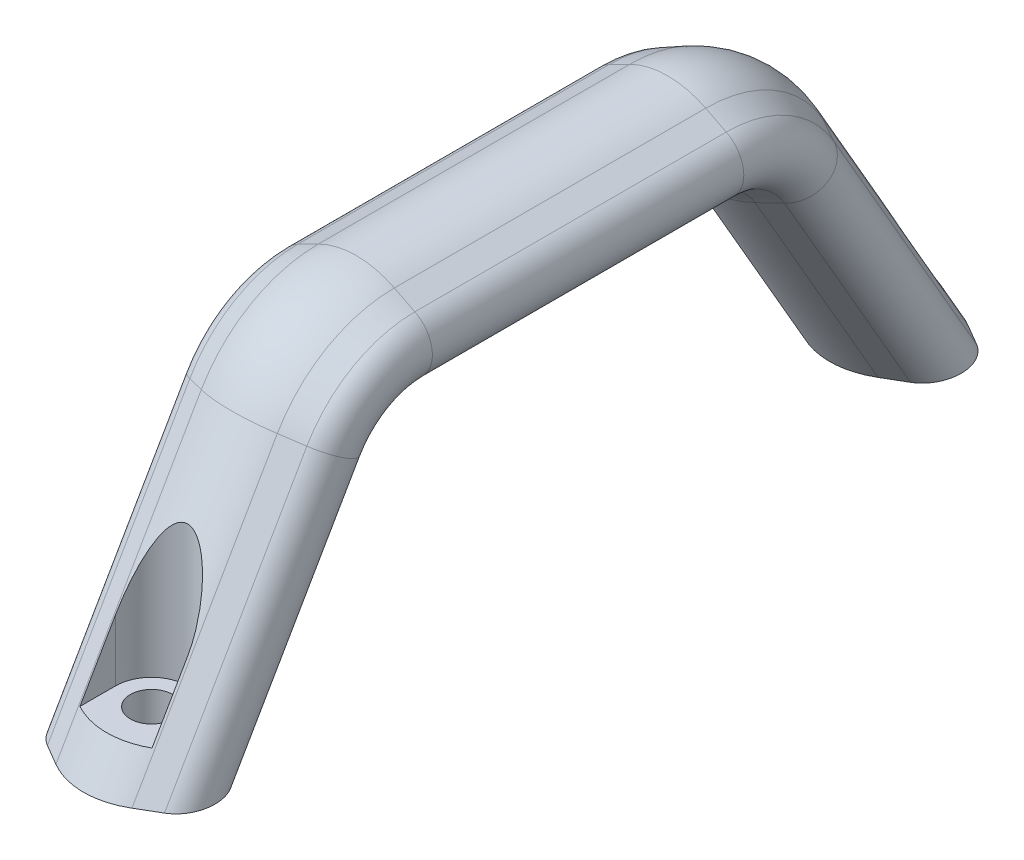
ISO-10303-21;
HEADER;
FILE_DESCRIPTION(('STEP AP214'),'2;1');
FILE_NAME('part.step','',(''),(''),'','','');
FILE_SCHEMA(('AUTOMOTIVE_DESIGN { 1 0 10303 214 1 1 1 1 }'));
ENDSEC;
DATA;
#1=APPLICATION_CONTEXT('core data for automotive mechanical design processes');
#2=APPLICATION_PROTOCOL_DEFINITION('international standard','automotive_design',2000,#1);
#3=PRODUCT_CONTEXT('',#1,'mechanical');
#4=PRODUCT('Part','Part','',(#3));
#5=PRODUCT_RELATED_PRODUCT_CATEGORY('part','',(#4));
#6=PRODUCT_DEFINITION_FORMATION('','',#4);
#7=PRODUCT_DEFINITION_CONTEXT('part definition',#1,'design');
#8=PRODUCT_DEFINITION('design','',#6,#7);
#9=PRODUCT_DEFINITION_SHAPE('','',#8);
#10=(LENGTH_UNIT() NAMED_UNIT(*) SI_UNIT(.MILLI.,.METRE.));
#11=(NAMED_UNIT(*) PLANE_ANGLE_UNIT() SI_UNIT($,.RADIAN.));
#12=(NAMED_UNIT(*) SI_UNIT($,.STERADIAN.) SOLID_ANGLE_UNIT());
#13=UNCERTAINTY_MEASURE_WITH_UNIT(LENGTH_MEASURE(1.E-05),#10,'distance_accuracy_value','');
#14=(GEOMETRIC_REPRESENTATION_CONTEXT(3) GLOBAL_UNCERTAINTY_ASSIGNED_CONTEXT((#13)) GLOBAL_UNIT_ASSIGNED_CONTEXT((#10,
#11,#12)) REPRESENTATION_CONTEXT('',''));
#15=CARTESIAN_POINT('',(0.,0.,0.));
#16=DIRECTION('',(0.,0.,1.));
#17=DIRECTION('',(1.,0.,0.));
#18=AXIS2_PLACEMENT_3D('',#15,#16,#17);
#19=CARTESIAN_POINT('',(0.,26.7499999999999,25.9315246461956));
#20=DIRECTION('',(0.,-0.866025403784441,0.499999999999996));
#21=DIRECTION('',(0.,-0.499999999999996,-0.866025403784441));
#22=AXIS2_PLACEMENT_3D('',#19,#20,#21);
#23=CYLINDRICAL_SURFACE('',#22,10.5);
#24=DIRECTION('',(0.,-0.866025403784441,0.499999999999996));
#25=VECTOR('',#24,1.);
#26=CARTESIAN_POINT('',(-4.5,31.4934164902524,34.1473630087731));
#27=LINE('',#26,#25);
#28=CARTESIAN_POINT('',(-4.5,12.6960978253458,45.));
#29=VERTEX_POINT('',#28);
#30=CARTESIAN_POINT('',(-4.5,5.00000000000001,49.443344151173));
#31=VERTEX_POINT('',#30);
#32=EDGE_CURVE('E242',#29,#31,#27,.T.);
#33=ORIENTED_EDGE('',*,*,#32,.F.);
#34=CARTESIAN_POINT('',(0.,22.5166604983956,40.5));
#35=CARTESIAN_POINT('',(0.102948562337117,22.5166449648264,40.5000058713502));
#36=CARTESIAN_POINT('',(0.205961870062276,22.5073934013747,40.5035779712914));
#37=CARTESIAN_POINT('',(0.408482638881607,22.4715741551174,40.5174210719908));
#38=CARTESIAN_POINT('',(0.507984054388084,22.4449780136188,40.527703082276));
#39=CARTESIAN_POINT('',(0.725618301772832,22.3687765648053,40.5572062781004));
#40=CARTESIAN_POINT('',(0.842059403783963,22.3150414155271,40.5780352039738));
#41=CARTESIAN_POINT('',(1.06432220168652,22.191137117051,40.6261868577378));
#42=CARTESIAN_POINT('',(1.17012003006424,22.1209321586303,40.6535237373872));
#43=CARTESIAN_POINT('',(1.35764615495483,21.9795748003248,40.7087328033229));
#44=CARTESIAN_POINT('',(1.44068203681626,21.9098869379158,40.7360117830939));
#45=CARTESIAN_POINT('',(1.6000528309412,21.7641582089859,40.7932189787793));
#46=CARTESIAN_POINT('',(1.67638238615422,21.6881123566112,40.8231492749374));
#47=CARTESIAN_POINT('',(1.82322018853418,21.5311413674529,40.8851209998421));
#48=CARTESIAN_POINT('',(1.89371641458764,21.4502067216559,40.9171665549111));
#49=CARTESIAN_POINT('',(2.02943026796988,21.2847357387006,40.9829001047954));
#50=CARTESIAN_POINT('',(2.09464937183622,21.2002004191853,41.0165876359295));
#51=CARTESIAN_POINT('',(2.24382429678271,20.9964000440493,41.0980866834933));
#52=CARTESIAN_POINT('',(2.32574849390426,20.8758915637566,41.1464991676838));
#53=CARTESIAN_POINT('',(2.48224073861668,20.6309793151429,41.2453972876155));
#54=CARTESIAN_POINT('',(2.55680558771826,20.5065738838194,41.2958838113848));
#55=CARTESIAN_POINT('',(2.69965819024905,20.2546841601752,41.3986669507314));
#56=CARTESIAN_POINT('',(2.76793658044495,20.1271956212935,41.4509661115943));
#57=CARTESIAN_POINT('',(2.89887822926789,19.8699809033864,41.5570949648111));
#58=CARTESIAN_POINT('',(2.96154054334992,19.7402543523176,41.6109249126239));
#59=CARTESIAN_POINT('',(3.14278115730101,19.3469090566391,41.7751434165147));
#60=CARTESIAN_POINT('',(3.25376755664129,19.080656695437,41.8876369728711));
#61=CARTESIAN_POINT('',(3.45896037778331,18.5441908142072,42.1174248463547));
#62=CARTESIAN_POINT('',(3.55318010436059,18.2739806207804,42.2347152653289));
#63=CARTESIAN_POINT('',(3.72163741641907,17.7479905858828,42.466500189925));
#64=CARTESIAN_POINT('',(3.79675657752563,17.4923660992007,42.5807102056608));
#65=CARTESIAN_POINT('',(3.93530059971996,16.9798049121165,42.8132837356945));
#66=CARTESIAN_POINT('',(3.99872367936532,16.722868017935,42.9316478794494));
#67=CARTESIAN_POINT('',(4.11452022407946,16.2081616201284,43.1728067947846));
#68=CARTESIAN_POINT('',(4.16687913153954,15.9503914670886,43.2956071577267));
#69=CARTESIAN_POINT('',(4.26061856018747,15.4350599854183,43.54570915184));
#70=CARTESIAN_POINT('',(4.30199986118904,15.1774986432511,43.6730104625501));
#71=CARTESIAN_POINT('',(4.37337711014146,14.6648281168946,43.9316116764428));
#72=CARTESIAN_POINT('',(4.40344194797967,14.409713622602,44.0628819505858));
#73=CARTESIAN_POINT('',(4.45199787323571,13.9010041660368,44.3305111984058));
#74=CARTESIAN_POINT('',(4.47048767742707,13.6474093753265,44.4668707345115));
#75=CARTESIAN_POINT('',(4.49491939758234,13.1429674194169,44.7447917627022));
#76=CARTESIAN_POINT('',(4.50088060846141,12.8921166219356,44.8863449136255));
#77=CARTESIAN_POINT('',(4.4989094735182,12.3938102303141,45.1751243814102));
#78=CARTESIAN_POINT('',(4.49098175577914,12.1463535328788,45.3223487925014));
#79=CARTESIAN_POINT('',(4.46469486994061,11.7399822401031,45.5712652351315));
#80=CARTESIAN_POINT('',(4.45083495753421,11.5797524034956,45.6712939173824));
#81=CARTESIAN_POINT('',(4.41552915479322,11.2617384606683,45.8738880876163));
#82=CARTESIAN_POINT('',(4.39408351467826,11.1039542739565,45.9764534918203));
#83=CARTESIAN_POINT('',(4.34272842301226,10.7912414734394,46.1841291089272));
#84=CARTESIAN_POINT('',(4.31281139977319,10.6363155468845,46.2892415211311));
#85=CARTESIAN_POINT('',(4.24350521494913,10.3301420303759,46.5017163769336));
#86=CARTESIAN_POINT('',(4.20411604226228,10.1788944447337,46.6090788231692));
#87=CARTESIAN_POINT('',(4.11424042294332,9.87942093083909,46.8267539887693));
#88=CARTESIAN_POINT('',(4.06364682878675,9.73124041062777,46.9370854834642));
#89=CARTESIAN_POINT('',(3.95021938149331,9.4405261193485,47.1590039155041));
#90=CARTESIAN_POINT('',(3.88738375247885,9.29799317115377,47.2705910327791));
#91=CARTESIAN_POINT('',(3.74812686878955,9.02017100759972,47.4937533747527));
#92=CARTESIAN_POINT('',(3.67173291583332,8.88486793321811,47.6053281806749));
#93=CARTESIAN_POINT('',(3.50384354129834,8.62285309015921,47.8270840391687));
#94=CARTESIAN_POINT('',(3.4123566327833,8.49613653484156,47.937265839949));
#95=CARTESIAN_POINT('',(3.18372002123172,8.21746677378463,48.185938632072));
#96=CARTESIAN_POINT('',(3.04103773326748,8.06895140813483,48.3232994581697));
#97=CARTESIAN_POINT('',(2.72617169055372,7.79365563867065,48.5860634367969));
#98=CARTESIAN_POINT('',(2.55399922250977,7.66686695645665,48.711471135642));
#99=CARTESIAN_POINT('',(2.27341480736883,7.49603569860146,48.8850883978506));
#100=CARTESIAN_POINT('',(2.17554664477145,7.44206762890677,48.9408187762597));
#101=CARTESIAN_POINT('',(1.97295345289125,7.34146545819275,49.0460421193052));
#102=CARTESIAN_POINT('',(1.86823206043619,7.29482751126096,49.0955383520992));
#103=CARTESIAN_POINT('',(1.6526037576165,7.20940981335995,49.1871976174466));
#104=CARTESIAN_POINT('',(1.5416992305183,7.17062706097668,49.229363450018));
#105=CARTESIAN_POINT('',(1.31457750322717,7.10133905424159,49.3053704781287));
#106=CARTESIAN_POINT('',(1.19836131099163,7.07083223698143,49.3392132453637));
#107=CARTESIAN_POINT('',(0.978404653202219,7.02212991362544,49.3935973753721));
#108=CARTESIAN_POINT('',(0.875208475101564,7.00280632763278,49.4153400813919));
#109=CARTESIAN_POINT('',(0.666561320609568,6.97068947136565,49.4516180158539));
#110=CARTESIAN_POINT('',(0.561110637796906,6.95789535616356,49.4661541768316));
#111=CARTESIAN_POINT('',(0.348900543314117,6.93894890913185,49.4877209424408));
#112=CARTESIAN_POINT('',(0.242141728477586,6.93279365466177,49.4947548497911));
#113=CARTESIAN_POINT('',(0.0282205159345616,6.9271671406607,49.50118335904));
#114=CARTESIAN_POINT('',(-0.0789418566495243,6.92769547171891,49.5005784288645));
#115=CARTESIAN_POINT('',(-0.281924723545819,6.93503962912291,49.492190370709));
#116=CARTESIAN_POINT('',(-0.377799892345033,6.94121646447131,49.4851367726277));
#117=CARTESIAN_POINT('',(-0.568442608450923,6.95892834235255,49.4649819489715));
#118=CARTESIAN_POINT('',(-0.66320980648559,6.97046503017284,49.4518788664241));
#119=CARTESIAN_POINT('',(-0.850897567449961,6.99881282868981,49.4198446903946));
#120=CARTESIAN_POINT('',(-0.943819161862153,7.0156208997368,49.4009169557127));
#121=CARTESIAN_POINT('',(-1.1272785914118,7.0543933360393,49.3575391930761));
#122=CARTESIAN_POINT('',(-1.21781551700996,7.07635963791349,49.3330870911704));
#123=CARTESIAN_POINT('',(-1.4863042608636,7.15015516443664,49.2515819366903));
#124=CARTESIAN_POINT('',(-1.65985803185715,7.20968781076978,49.1866037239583));
#125=CARTESIAN_POINT('',(-1.99137235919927,7.34747007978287,49.039483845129));
#126=CARTESIAN_POINT('',(-2.14932883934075,7.42572457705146,48.9573377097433));
#127=CARTESIAN_POINT('',(-2.46250430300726,7.60749417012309,48.7712641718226));
#128=CARTESIAN_POINT('',(-2.61590764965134,7.7127420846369,48.665986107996));
#129=CARTESIAN_POINT('',(-2.90080888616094,7.94041569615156,48.4449799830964));
#130=CARTESIAN_POINT('',(-3.03229362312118,8.06285162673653,48.3292457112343));
#131=CARTESIAN_POINT('',(-3.25066772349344,8.29681070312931,48.1147795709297));
#132=CARTESIAN_POINT('',(-3.34126582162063,8.40587646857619,48.0170794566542));
#133=CARTESIAN_POINT('',(-3.50955262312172,8.63184789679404,47.8195537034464));
#134=CARTESIAN_POINT('',(-3.5872347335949,8.74875752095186,47.7197270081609));
#135=CARTESIAN_POINT('',(-3.73077946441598,8.98929688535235,47.5192297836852));
#136=CARTESIAN_POINT('',(-3.79662111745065,9.11293805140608,47.4185580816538));
#137=CARTESIAN_POINT('',(-3.91743751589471,9.36569496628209,47.2175285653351));
#138=CARTESIAN_POINT('',(-3.97240815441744,9.49481276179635,47.1171708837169));
#139=CARTESIAN_POINT('',(-4.1054117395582,9.84381474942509,46.8519906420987));
#140=CARTESIAN_POINT('',(-4.17490748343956,10.0676612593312,46.6880806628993));
#141=CARTESIAN_POINT('',(-4.29139992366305,10.5245015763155,46.3650552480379));
#142=CARTESIAN_POINT('',(-4.33838047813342,10.7575018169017,46.2059433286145));
#143=CARTESIAN_POINT('',(-4.41347168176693,11.2308774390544,45.8928858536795));
#144=CARTESIAN_POINT('',(-4.44152483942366,11.4712729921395,45.7389573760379));
#145=CARTESIAN_POINT('',(-4.48133006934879,11.9570661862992,45.4369083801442));
#146=CARTESIAN_POINT('',(-4.49307622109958,12.2024656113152,45.2887899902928));
#147=CARTESIAN_POINT('',(-4.5020156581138,12.6793212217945,45.0085821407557));
#148=CARTESIAN_POINT('',(-4.50018181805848,12.9105322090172,44.8761008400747));
#149=CARTESIAN_POINT('',(-4.48546833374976,13.3751920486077,44.6158722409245));
#150=CARTESIAN_POINT('',(-4.47259034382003,13.6086405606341,44.4881242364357));
#151=CARTESIAN_POINT('',(-4.43664890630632,14.0773776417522,44.2369420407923));
#152=CARTESIAN_POINT('',(-4.41357459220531,14.3126679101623,44.1135126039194));
#153=CARTESIAN_POINT('',(-4.35780841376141,14.784263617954,43.8708385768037));
#154=CARTESIAN_POINT('',(-4.32511632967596,15.0205690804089,43.7515940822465));
#155=CARTESIAN_POINT('',(-4.2505032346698,15.4930756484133,43.5173348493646));
#156=CARTESIAN_POINT('',(-4.20860513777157,15.7292755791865,43.4023104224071));
#157=CARTESIAN_POINT('',(-4.11556732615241,16.2016457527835,43.175971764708));
#158=CARTESIAN_POINT('',(-4.06442725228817,16.4378159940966,43.0646576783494));
#159=CARTESIAN_POINT('',(-3.9527266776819,16.9093529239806,42.8456916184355));
#160=CARTESIAN_POINT('',(-3.89217483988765,17.1447201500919,42.7380363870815));
#161=CARTESIAN_POINT('',(-3.76110030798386,17.6142136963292,42.5262081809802));
#162=CARTESIAN_POINT('',(-3.6905792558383,17.848340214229,42.4220346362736));
#163=CARTESIAN_POINT('',(-3.56825709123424,18.2237416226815,42.2570840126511));
#164=CARTESIAN_POINT('',(-3.51986735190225,18.3656528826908,42.1952123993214));
#165=CARTESIAN_POINT('',(-3.41873857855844,18.6484925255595,42.0727942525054));
#166=CARTESIAN_POINT('',(-3.36599972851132,18.7894209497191,42.0122476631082));
#167=CARTESIAN_POINT('',(-3.25571663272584,19.0702285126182,41.8924367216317));
#168=CARTESIAN_POINT('',(-3.19816520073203,19.2101057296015,41.8331744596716));
#169=CARTESIAN_POINT('',(-3.07784607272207,19.4882216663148,41.7161137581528));
#170=CARTESIAN_POINT('',(-3.01507851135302,19.626460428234,41.6583152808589));
#171=CARTESIAN_POINT('',(-2.87487906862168,19.9192648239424,41.5366469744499));
#172=CARTESIAN_POINT('',(-2.79661012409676,20.0735274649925,41.4730053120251));
#173=CARTESIAN_POINT('',(-2.63134341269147,20.3784073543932,41.3480448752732));
#174=CARTESIAN_POINT('',(-2.54434192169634,20.5290230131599,41.2867271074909));
#175=CARTESIAN_POINT('',(-2.360350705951,20.8245240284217,41.1671487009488));
#176=CARTESIAN_POINT('',(-2.26339716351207,20.9694276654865,41.1088780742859));
#177=CARTESIAN_POINT('',(-2.05718174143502,21.2516143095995,40.9960223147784));
#178=CARTESIAN_POINT('',(-1.94793380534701,21.3889056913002,40.9414331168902));
#179=CARTESIAN_POINT('',(-1.73976500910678,21.6232253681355,40.8487142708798));
#180=CARTESIAN_POINT('',(-1.64382763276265,21.7224837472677,40.8095992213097));
#181=CARTESIAN_POINT('',(-1.44077175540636,21.9111333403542,40.7355059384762));
#182=CARTESIAN_POINT('',(-1.33363450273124,22.0005074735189,40.7005348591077));
#183=CARTESIAN_POINT('',(-1.10468349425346,22.1657413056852,40.6360589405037));
#184=CARTESIAN_POINT('',(-0.982666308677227,22.2413676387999,40.6066482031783));
#185=CARTESIAN_POINT('',(-0.78992911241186,22.3373494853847,40.5693938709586));
#186=CARTESIAN_POINT('',(-0.724181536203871,22.3664001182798,40.5581323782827));
#187=CARTESIAN_POINT('',(-0.589701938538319,22.4176290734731,40.538289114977));
#188=CARTESIAN_POINT('',(-0.52097283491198,22.4398139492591,40.5297047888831));
#189=CARTESIAN_POINT('',(-0.377707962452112,22.4771238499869,40.5152752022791));
#190=CARTESIAN_POINT('',(-0.303052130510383,22.4918554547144,40.5095825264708));
#191=CARTESIAN_POINT('',(-0.152275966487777,22.5116293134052,40.5019428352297));
#192=CARTESIAN_POINT('',(-0.0761556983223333,22.5166719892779,40.4999956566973));
#193=CARTESIAN_POINT('',(0.,22.5166604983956,40.5));
#194=B_SPLINE_CURVE_WITH_KNOTS('',3,(#34,#35,#36,#37,#38,#39,#40,#41,#42,#43,#44,#45,#46,#47,
#48,#49,#50,#51,#52,#53,#54,#55,#56,#57,#58,#59,#60,#61,#62,#63,#64,#65,#66,#67,#68,#69,#70,#71,
#72,#73,#74,#75,#76,#77,#78,#79,#80,#81,#82,#83,#84,#85,#86,#87,#88,#89,#90,#91,#92,#93,#94,#95,
#96,#97,#98,#99,#100,#101,#102,#103,#104,#105,#106,#107,#108,#109,#110,#111,#112,#113,#114,#115,
#116,#117,#118,#119,#120,#121,#122,#123,#124,#125,#126,#127,#128,#129,#130,#131,#132,#133,#134,
#135,#136,#137,#138,#139,#140,#141,#142,#143,#144,#145,#146,#147,#148,#149,#150,#151,#152,#153,
#154,#155,#156,#157,#158,#159,#160,#161,#162,#163,#164,#165,#166,#167,#168,#169,#170,#171,#172,
#173,#174,#175,#176,#177,#178,#179,#180,#181,#182,#183,#184,#185,#186,#187,#188,#189,#190,#191,
#192,#193),.UNSPECIFIED.,.T.,.F.,(4,2,2,2,2,2,2,2,2,2,2,2,2,2,2,2,2,2,2,2,2,2,2,2,2,2,2,2,2,2,2,
2,2,2,2,2,2,2,2,2,2,2,2,2,2,2,2,2,2,2,2,2,2,2,2,2,2,2,2,2,2,2,2,2,2,2,2,2,2,2,2,2,2,2,2,2,2,2,2,
4),(0.,0.308516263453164,0.617540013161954,1.00510105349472,1.39351268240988,1.72838455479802,
2.06352153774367,2.399332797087,2.73504976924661,3.19538702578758,3.65592347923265,
4.11713513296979,4.57842421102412,5.50656154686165,6.43395906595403,7.30331077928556,
8.17279479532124,9.04341580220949,9.91397494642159,10.7791453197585,11.6444115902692,
12.5083443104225,13.3719892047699,13.9400255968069,14.5080432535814,15.0765702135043,
15.6450978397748,16.219317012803,16.7936195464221,17.3667784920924,17.9396152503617,
18.6797506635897,19.419603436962,19.7937936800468,20.1677869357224,20.5416370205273,
20.9154164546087,21.236624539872,21.5577910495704,21.8788161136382,22.1998215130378,
22.4884774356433,22.7772220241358,23.0658004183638,23.3544873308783,23.9357437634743,
24.5171517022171,25.1560590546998,25.7953484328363,26.3112034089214,26.827320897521,
27.3443435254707,27.8615611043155,28.7181812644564,29.5754146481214,30.4352402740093,
31.2953779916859,32.0945237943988,32.8935499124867,33.6934296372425,34.4933276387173,
35.2912567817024,36.0892169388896,36.886446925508,37.6835457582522,38.170086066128,
38.6566058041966,39.1438654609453,39.6311125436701,40.1838518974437,40.7368279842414,
41.2878604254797,41.8382741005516,42.2680669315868,42.6985912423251,43.1358526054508,
43.3537636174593,43.5714659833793,43.7996993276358,44.0279227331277),.UNSPECIFIED.);
#195=CARTESIAN_POINT('',(4.5,12.6960978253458,45.));
#196=VERTEX_POINT('',#195);
#197=EDGE_CURVE('E37',#29,#196,#194,.T.);
#198=ORIENTED_EDGE('',*,*,#197,.T.);
#199=DIRECTION('',(0.,-0.866025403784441,0.499999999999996));
#200=VECTOR('',#199,1.);
#201=CARTESIAN_POINT('',(4.5,31.4934164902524,34.1473630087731));
#202=LINE('',#201,#200);
#203=CARTESIAN_POINT('',(4.5,5.00000000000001,49.4433441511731));
#204=VERTEX_POINT('',#203);
#205=EDGE_CURVE('E55',#196,#204,#202,.T.);
#206=ORIENTED_EDGE('',*,*,#205,.T.);
#207=CARTESIAN_POINT('',(0.,5.,38.4888930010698));
#208=DIRECTION('',(0.,1.,0.));
#209=DIRECTION('',(0.,0.,1.));
#210=AXIS2_PLACEMENT_3D('',#207,#208,#209);
#211=ELLIPSE('',#210,12.1243556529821,10.5);
#212=EDGE_CURVE('E254',#204,#31,#211,.F.);
#213=ORIENTED_EDGE('',*,*,#212,.T.);
#214=EDGE_LOOP('',(#33,#198,#206,#213));
#215=FACE_BOUND('',#214,.T.);
#216=CARTESIAN_POINT('',(0.,0.,41.3756443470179));
#217=DIRECTION('',(0.,-1.,0.));
#218=DIRECTION('',(0.,0.,1.));
#219=AXIS2_PLACEMENT_3D('',#216,#217,#218);
#220=ELLIPSE('',#219,12.1243556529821,10.5);
#221=CARTESIAN_POINT('',(-4.74573678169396,0.,52.1909410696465));
#222=VERTEX_POINT('',#221);
#223=CARTESIAN_POINT('',(4.74573678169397,0.,52.1909410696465));
#224=VERTEX_POINT('',#223);
#225=EDGE_CURVE('E304',#222,#224,#220,.F.);
#226=ORIENTED_EDGE('',*,*,#225,.T.);
#227=DIRECTION('',(0.,-0.866025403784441,0.499999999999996));
#228=VECTOR('',#227,1.);
#229=CARTESIAN_POINT('',(4.74573678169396,31.4331608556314,34.0429971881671));
#230=LINE('',#229,#228);
#231=CARTESIAN_POINT('',(4.74573678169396,31.4331608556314,34.0429971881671));
#232=VERTEX_POINT('',#231);
#233=EDGE_CURVE('E369',#232,#224,#230,.T.);
#234=ORIENTED_EDGE('',*,*,#233,.F.);
#235=CARTESIAN_POINT('',(0.,26.7499999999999,25.9315246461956));
#236=DIRECTION('',(0.,-0.866025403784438,0.500000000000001));
#237=DIRECTION('',(0.,-0.500000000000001,-0.866025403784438));
#238=AXIS2_PLACEMENT_3D('',#235,#236,#237);
#239=CIRCLE('',#238,10.5);
#240=CARTESIAN_POINT('',(-4.74573678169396,31.4331608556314,34.0429971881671));
#241=VERTEX_POINT('',#240);
#242=EDGE_CURVE('E343',#232,#241,#239,.T.);
#243=ORIENTED_EDGE('',*,*,#242,.T.);
#244=DIRECTION('',(0.,-0.866025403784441,0.499999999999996));
#245=VECTOR('',#244,1.);
#246=CARTESIAN_POINT('',(-4.74573678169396,31.4331608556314,34.0429971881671));
#247=LINE('',#246,#245);
#248=EDGE_CURVE('E366',#241,#222,#247,.T.);
#249=ORIENTED_EDGE('',*,*,#248,.T.);
#250=EDGE_LOOP('',(#226,#234,#243,#249));
#251=FACE_BOUND('',#250,.T.);
#252=ADVANCED_FACE('F33',(#215,#251),#23,.T.);
#253=CARTESIAN_POINT('',(0.,0.,0.));
#254=DIRECTION('',(0.,-1.,0.));
#255=DIRECTION('',(0.,0.,-1.));
#256=AXIS2_PLACEMENT_3D('',#253,#254,#255);
#257=PLANE('',#256);
#258=CARTESIAN_POINT('',(-5.49999999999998,0.,46.5717967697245));
#259=DIRECTION('',(0.,-1.,0.));
#260=DIRECTION('',(0.,0.,1.));
#261=AXIS2_PLACEMENT_3D('',#258,#259,#260);
#262=ELLIPSE('',#261,4.61880215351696,3.99999999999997);
#263=CARTESIAN_POINT('',(-7.30789972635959,0.,42.4516837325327));
#264=VERTEX_POINT('',#263);
#265=CARTESIAN_POINT('',(-7.30789972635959,0.,50.6919098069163));
#266=VERTEX_POINT('',#265);
#267=EDGE_CURVE('E311',#264,#266,#262,.F.);
#268=ORIENTED_EDGE('',*,*,#267,.F.);
#269=DIRECTION('',(-0.863127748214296,0.,0.504985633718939));
#270=VECTOR('',#269,1.);
#271=CARTESIAN_POINT('',(1.93975502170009,0.,37.0412067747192));
#272=LINE('',#271,#270);
#273=CARTESIAN_POINT('',(-4.74573678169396,0.,40.9526524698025));
#274=VERTEX_POINT('',#273);
#275=EDGE_CURVE('E303',#274,#264,#272,.T.);
#276=ORIENTED_EDGE('',*,*,#275,.F.);
#277=CARTESIAN_POINT('',(0.,0.,51.7679491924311));
#278=DIRECTION('',(0.,-1.,0.));
#279=DIRECTION('',(0.,0.,1.));
#280=AXIS2_PLACEMENT_3D('',#277,#278,#279);
#281=ELLIPSE('',#280,12.1243556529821,10.5);
#282=CARTESIAN_POINT('',(4.74573678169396,0.,40.9526524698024));
#283=VERTEX_POINT('',#282);
#284=EDGE_CURVE('E295',#283,#274,#281,.F.);
#285=ORIENTED_EDGE('',*,*,#284,.F.);
#286=DIRECTION('',(-0.863127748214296,0.,-0.504985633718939));
#287=VECTOR('',#286,1.);
#288=CARTESIAN_POINT('',(0.459063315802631,0.,38.4446708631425));
#289=LINE('',#288,#287);
#290=CARTESIAN_POINT('',(7.30789972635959,0.,42.4516837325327));
#291=VERTEX_POINT('',#290);
#292=EDGE_CURVE('E292',#291,#283,#289,.T.);
#293=ORIENTED_EDGE('',*,*,#292,.F.);
#294=CARTESIAN_POINT('',(5.5,0.,46.5717967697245));
#295=DIRECTION('',(0.,-1.,0.));
#296=DIRECTION('',(0.,0.,1.));
#297=AXIS2_PLACEMENT_3D('',#294,#295,#296);
#298=ELLIPSE('',#297,4.61880215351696,3.99999999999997);
#299=CARTESIAN_POINT('',(7.30789972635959,0.,50.6919098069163));
#300=VERTEX_POINT('',#299);
#301=EDGE_CURVE('E296',#300,#291,#298,.F.);
#302=ORIENTED_EDGE('',*,*,#301,.F.);
#303=DIRECTION('',(0.863127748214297,0.,-0.504985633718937));
#304=VECTOR('',#303,1.);
#305=CARTESIAN_POINT('',(12.6558286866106,0.,47.5630250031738));
#306=LINE('',#305,#304);
#307=EDGE_CURVE('E298',#224,#300,#306,.T.);
#308=ORIENTED_EDGE('',*,*,#307,.F.);
#309=ORIENTED_EDGE('',*,*,#225,.F.);
#310=DIRECTION('',(0.863127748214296,0.,0.504985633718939));
#311=VECTOR('',#310,1.);
#312=CARTESIAN_POINT('',(-15.0546470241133,0.,46.1595609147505));
#313=LINE('',#312,#311);
#314=EDGE_CURVE('E306',#266,#222,#313,.T.);
#315=ORIENTED_EDGE('',*,*,#314,.F.);
#316=EDGE_LOOP('',(#268,#276,#285,#293,#302,#308,#309,#315));
#317=FACE_BOUND('',#316,.T.);
#318=CARTESIAN_POINT('',(0.,0.,45.));
#319=DIRECTION('',(0.,-1.,0.));
#320=DIRECTION('',(0.,0.,-1.));
#321=AXIS2_PLACEMENT_3D('',#318,#319,#320);
#322=CIRCLE('',#321,2.65);
#323=CARTESIAN_POINT('',(0.,0.,42.35));
#324=VERTEX_POINT('',#323);
#325=EDGE_CURVE('E262',#324,#324,#322,.T.);
#326=ORIENTED_EDGE('',*,*,#325,.F.);
#327=EDGE_LOOP('',(#326));
#328=FACE_BOUND('',#327,.T.);
#329=ADVANCED_FACE('F557',(#317,#328),#257,.T.);
#330=CARTESIAN_POINT('',(0.,41.,-45.));
#331=DIRECTION('',(0.,1.,0.));
#332=DIRECTION('',(0.,0.,1.));
#333=AXIS2_PLACEMENT_3D('',#330,#331,#332);
#334=CYLINDRICAL_SURFACE('',#333,4.5);
#335=CARTESIAN_POINT('',(0.,5.,-45.));
#336=DIRECTION('',(0.,1.,0.));
#337=DIRECTION('',(0.,0.,1.));
#338=AXIS2_PLACEMENT_3D('',#335,#336,#337);
#339=CIRCLE('',#338,4.5);
#340=CARTESIAN_POINT('',(-4.5,5.00000000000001,-45.));
#341=VERTEX_POINT('',#340);
#342=CARTESIAN_POINT('',(4.5,5.,-45.));
#343=VERTEX_POINT('',#342);
#344=EDGE_CURVE('E288',#341,#343,#339,.T.);
#345=ORIENTED_EDGE('',*,*,#344,.F.);
#346=DIRECTION('',(0.,-1.,0.));
#347=VECTOR('',#346,1.);
#348=CARTESIAN_POINT('',(-4.5,5.00000000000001,-45.));
#349=LINE('',#348,#347);
#350=CARTESIAN_POINT('',(-4.5,12.6960978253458,-45.));
#351=VERTEX_POINT('',#350);
#352=EDGE_CURVE('E269',#351,#341,#349,.T.);
#353=ORIENTED_EDGE('',*,*,#352,.F.);
#354=CARTESIAN_POINT('',(0.,22.5166604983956,-40.5));
#355=CARTESIAN_POINT('',(0.102948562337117,22.5166449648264,-40.5000058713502));
#356=CARTESIAN_POINT('',(0.205961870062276,22.5073934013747,-40.5035779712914));
#357=CARTESIAN_POINT('',(0.408482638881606,22.4715741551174,-40.5174210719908));
#358=CARTESIAN_POINT('',(0.507984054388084,22.4449780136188,-40.527703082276));
#359=CARTESIAN_POINT('',(0.725618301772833,22.3687765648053,-40.5572062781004));
#360=CARTESIAN_POINT('',(0.842059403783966,22.3150414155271,-40.5780352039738));
#361=CARTESIAN_POINT('',(1.06432220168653,22.191137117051,-40.6261868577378));
#362=CARTESIAN_POINT('',(1.17012003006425,22.1209321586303,-40.6535237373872));
#363=CARTESIAN_POINT('',(1.35764615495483,21.9795748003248,-40.7087328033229));
#364=CARTESIAN_POINT('',(1.44068203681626,21.9098869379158,-40.7360117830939));
#365=CARTESIAN_POINT('',(1.60005283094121,21.7641582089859,-40.7932189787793));
#366=CARTESIAN_POINT('',(1.67638238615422,21.6881123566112,-40.8231492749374));
#367=CARTESIAN_POINT('',(1.82322018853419,21.5311413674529,-40.8851209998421));
#368=CARTESIAN_POINT('',(1.89371641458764,21.4502067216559,-40.9171665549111));
#369=CARTESIAN_POINT('',(2.02943026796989,21.2847357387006,-40.9829001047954));
#370=CARTESIAN_POINT('',(2.09464937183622,21.2002004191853,-41.0165876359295));
#371=CARTESIAN_POINT('',(2.24382429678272,20.9964000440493,-41.0980866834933));
#372=CARTESIAN_POINT('',(2.32574849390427,20.8758915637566,-41.1464991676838));
#373=CARTESIAN_POINT('',(2.48224073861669,20.6309793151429,-41.2453972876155));
#374=CARTESIAN_POINT('',(2.55680558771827,20.5065738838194,-41.2958838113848));
#375=CARTESIAN_POINT('',(2.69965819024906,20.2546841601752,-41.3986669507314));
#376=CARTESIAN_POINT('',(2.76793658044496,20.1271956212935,-41.4509661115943));
#377=CARTESIAN_POINT('',(2.8988782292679,19.8699809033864,-41.5570949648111));
#378=CARTESIAN_POINT('',(2.96154054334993,19.7402543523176,-41.6109249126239));
#379=CARTESIAN_POINT('',(3.14278115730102,19.3469090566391,-41.7751434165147));
#380=CARTESIAN_POINT('',(3.2537675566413,19.080656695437,-41.8876369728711));
#381=CARTESIAN_POINT('',(3.45896037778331,18.5441908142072,-42.1174248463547));
#382=CARTESIAN_POINT('',(3.5531801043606,18.2739806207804,-42.2347152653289));
#383=CARTESIAN_POINT('',(3.72163741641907,17.7479905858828,-42.466500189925));
#384=CARTESIAN_POINT('',(3.79675657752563,17.4923660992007,-42.5807102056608));
#385=CARTESIAN_POINT('',(3.93530059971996,16.9798049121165,-42.8132837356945));
#386=CARTESIAN_POINT('',(3.99872367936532,16.722868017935,-42.9316478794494));
#387=CARTESIAN_POINT('',(4.11452022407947,16.2081616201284,-43.1728067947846));
#388=CARTESIAN_POINT('',(4.16687913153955,15.9503914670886,-43.2956071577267));
#389=CARTESIAN_POINT('',(4.26061856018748,15.4350599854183,-43.54570915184));
#390=CARTESIAN_POINT('',(4.30199986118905,15.1774986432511,-43.6730104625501));
#391=CARTESIAN_POINT('',(4.37337711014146,14.6648281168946,-43.9316116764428));
#392=CARTESIAN_POINT('',(4.40344194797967,14.409713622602,-44.0628819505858));
#393=CARTESIAN_POINT('',(4.45199787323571,13.9010041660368,-44.3305111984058));
#394=CARTESIAN_POINT('',(4.47048767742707,13.6474093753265,-44.4668707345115));
#395=CARTESIAN_POINT('',(4.49491939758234,13.1429674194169,-44.7447917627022));
#396=CARTESIAN_POINT('',(4.50088060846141,12.8921166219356,-44.8863449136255));
#397=CARTESIAN_POINT('',(4.4989094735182,12.3938102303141,-45.1751243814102));
#398=CARTESIAN_POINT('',(4.49098175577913,12.1463535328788,-45.3223487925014));
#399=CARTESIAN_POINT('',(4.46469486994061,11.7399822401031,-45.5712652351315));
#400=CARTESIAN_POINT('',(4.4508349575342,11.5797524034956,-45.6712939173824));
#401=CARTESIAN_POINT('',(4.41552915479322,11.2617384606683,-45.8738880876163));
#402=CARTESIAN_POINT('',(4.39408351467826,11.1039542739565,-45.9764534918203));
#403=CARTESIAN_POINT('',(4.34272842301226,10.7912414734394,-46.1841291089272));
#404=CARTESIAN_POINT('',(4.31281139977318,10.6363155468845,-46.2892415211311));
#405=CARTESIAN_POINT('',(4.24350521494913,10.3301420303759,-46.5017163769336));
#406=CARTESIAN_POINT('',(4.20411604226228,10.1788944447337,-46.6090788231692));
#407=CARTESIAN_POINT('',(4.11424042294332,9.87942093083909,-46.8267539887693));
#408=CARTESIAN_POINT('',(4.06364682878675,9.73124041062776,-46.9370854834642));
#409=CARTESIAN_POINT('',(3.9502193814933,9.4405261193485,-47.1590039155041));
#410=CARTESIAN_POINT('',(3.88738375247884,9.29799317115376,-47.2705910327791));
#411=CARTESIAN_POINT('',(3.74812686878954,9.02017100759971,-47.4937533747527));
#412=CARTESIAN_POINT('',(3.67173291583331,8.88486793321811,-47.6053281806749));
#413=CARTESIAN_POINT('',(3.50384354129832,8.62285309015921,-47.8270840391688));
#414=CARTESIAN_POINT('',(3.41235663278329,8.49613653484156,-47.937265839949));
#415=CARTESIAN_POINT('',(3.1837200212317,8.21746677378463,-48.185938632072));
#416=CARTESIAN_POINT('',(3.04103773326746,8.06895140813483,-48.3232994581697));
#417=CARTESIAN_POINT('',(2.7261716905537,7.79365563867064,-48.5860634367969));
#418=CARTESIAN_POINT('',(2.55399922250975,7.66686695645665,-48.7114711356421));
#419=CARTESIAN_POINT('',(2.27341480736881,7.49603569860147,-48.8850883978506));
#420=CARTESIAN_POINT('',(2.17554664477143,7.44206762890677,-48.9408187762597));
#421=CARTESIAN_POINT('',(1.97295345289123,7.34146545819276,-49.0460421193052));
#422=CARTESIAN_POINT('',(1.86823206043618,7.29482751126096,-49.0955383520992));
#423=CARTESIAN_POINT('',(1.65260375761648,7.20940981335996,-49.1871976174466));
#424=CARTESIAN_POINT('',(1.54169923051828,7.17062706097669,-49.229363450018));
#425=CARTESIAN_POINT('',(1.31457750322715,7.1013390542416,-49.3053704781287));
#426=CARTESIAN_POINT('',(1.19836131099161,7.07083223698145,-49.3392132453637));
#427=CARTESIAN_POINT('',(0.978404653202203,7.02212991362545,-49.3935973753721));
#428=CARTESIAN_POINT('',(0.875208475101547,7.0028063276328,-49.4153400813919));
#429=CARTESIAN_POINT('',(0.66656132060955,6.97068947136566,-49.4516180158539));
#430=CARTESIAN_POINT('',(0.561110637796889,6.95789535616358,-49.4661541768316));
#431=CARTESIAN_POINT('',(0.348900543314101,6.93894890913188,-49.4877209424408));
#432=CARTESIAN_POINT('',(0.24214172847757,6.93279365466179,-49.4947548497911));
#433=CARTESIAN_POINT('',(0.0282205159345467,6.92716714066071,-49.50118335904));
#434=CARTESIAN_POINT('',(-0.0789418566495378,6.92769547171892,-49.5005784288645));
#435=CARTESIAN_POINT('',(-0.281924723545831,6.93503962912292,-49.492190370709));
#436=CARTESIAN_POINT('',(-0.377799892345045,6.94121646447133,-49.4851367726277));
#437=CARTESIAN_POINT('',(-0.568442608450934,6.95892834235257,-49.4649819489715));
#438=CARTESIAN_POINT('',(-0.663209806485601,6.97046503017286,-49.4518788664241));
#439=CARTESIAN_POINT('',(-0.850897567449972,6.99881282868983,-49.4198446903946));
#440=CARTESIAN_POINT('',(-0.943819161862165,7.01562089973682,-49.4009169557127));
#441=CARTESIAN_POINT('',(-1.12727859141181,7.05439333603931,-49.3575391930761));
#442=CARTESIAN_POINT('',(-1.21781551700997,7.07635963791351,-49.3330870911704));
#443=CARTESIAN_POINT('',(-1.48630426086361,7.15015516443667,-49.2515819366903));
#444=CARTESIAN_POINT('',(-1.65985803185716,7.2096878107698,-49.1866037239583));
#445=CARTESIAN_POINT('',(-1.99137235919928,7.34747007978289,-49.039483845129));
#446=CARTESIAN_POINT('',(-2.14932883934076,7.42572457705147,-48.9573377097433));
#447=CARTESIAN_POINT('',(-2.46250430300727,7.60749417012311,-48.7712641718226));
#448=CARTESIAN_POINT('',(-2.61590764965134,7.71274208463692,-48.665986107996));
#449=CARTESIAN_POINT('',(-2.90080888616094,7.94041569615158,-48.4449799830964));
#450=CARTESIAN_POINT('',(-3.03229362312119,8.06285162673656,-48.3292457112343));
#451=CARTESIAN_POINT('',(-3.25066772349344,8.29681070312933,-48.1147795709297));
#452=CARTESIAN_POINT('',(-3.34126582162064,8.4058764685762,-48.0170794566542));
#453=CARTESIAN_POINT('',(-3.50955262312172,8.63184789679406,-47.8195537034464));
#454=CARTESIAN_POINT('',(-3.58723473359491,8.74875752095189,-47.7197270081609));
#455=CARTESIAN_POINT('',(-3.73077946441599,8.98929688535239,-47.5192297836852));
#456=CARTESIAN_POINT('',(-3.79662111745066,9.11293805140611,-47.4185580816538));
#457=CARTESIAN_POINT('',(-3.91743751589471,9.36569496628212,-47.217528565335));
#458=CARTESIAN_POINT('',(-3.97240815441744,9.49481276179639,-47.1171708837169));
#459=CARTESIAN_POINT('',(-4.10541173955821,9.84381474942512,-46.8519906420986));
#460=CARTESIAN_POINT('',(-4.17490748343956,10.0676612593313,-46.6880806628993));
#461=CARTESIAN_POINT('',(-4.29139992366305,10.5245015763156,-46.3650552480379));
#462=CARTESIAN_POINT('',(-4.33838047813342,10.7575018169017,-46.2059433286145));
#463=CARTESIAN_POINT('',(-4.41347168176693,11.2308774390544,-45.8928858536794));
#464=CARTESIAN_POINT('',(-4.44152483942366,11.4712729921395,-45.7389573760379));
#465=CARTESIAN_POINT('',(-4.4813300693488,11.9570661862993,-45.4369083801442));
#466=CARTESIAN_POINT('',(-4.49307622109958,12.2024656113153,-45.2887899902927));
#467=CARTESIAN_POINT('',(-4.5020156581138,12.6793212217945,-45.0085821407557));
#468=CARTESIAN_POINT('',(-4.50018181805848,12.9105322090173,-44.8761008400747));
#469=CARTESIAN_POINT('',(-4.48546833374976,13.3751920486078,-44.6158722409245));
#470=CARTESIAN_POINT('',(-4.47259034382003,13.6086405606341,-44.4881242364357));
#471=CARTESIAN_POINT('',(-4.43664890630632,14.0773776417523,-44.2369420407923));
#472=CARTESIAN_POINT('',(-4.4135745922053,14.3126679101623,-44.1135126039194));
#473=CARTESIAN_POINT('',(-4.35780841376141,14.7842636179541,-43.8708385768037));
#474=CARTESIAN_POINT('',(-4.32511632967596,15.0205690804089,-43.7515940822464));
#475=CARTESIAN_POINT('',(-4.25050323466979,15.4930756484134,-43.5173348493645));
#476=CARTESIAN_POINT('',(-4.20860513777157,15.7292755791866,-43.4023104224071));
#477=CARTESIAN_POINT('',(-4.11556732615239,16.2016457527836,-43.175971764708));
#478=CARTESIAN_POINT('',(-4.06442725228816,16.4378159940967,-43.0646576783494));
#479=CARTESIAN_POINT('',(-3.95272667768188,16.9093529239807,-42.8456916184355));
#480=CARTESIAN_POINT('',(-3.89217483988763,17.144720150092,-42.7380363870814));
#481=CARTESIAN_POINT('',(-3.76110030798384,17.6142136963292,-42.5262081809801));
#482=CARTESIAN_POINT('',(-3.69057925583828,17.8483402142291,-42.4220346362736));
#483=CARTESIAN_POINT('',(-3.56825709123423,18.2237416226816,-42.2570840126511));
#484=CARTESIAN_POINT('',(-3.51986735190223,18.3656528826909,-42.1952123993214));
#485=CARTESIAN_POINT('',(-3.41873857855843,18.6484925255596,-42.0727942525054));
#486=CARTESIAN_POINT('',(-3.36599972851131,18.7894209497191,-42.0122476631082));
#487=CARTESIAN_POINT('',(-3.25571663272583,19.0702285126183,-41.8924367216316));
#488=CARTESIAN_POINT('',(-3.19816520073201,19.2101057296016,-41.8331744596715));
#489=CARTESIAN_POINT('',(-3.07784607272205,19.4882216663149,-41.7161137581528));
#490=CARTESIAN_POINT('',(-3.01507851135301,19.6264604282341,-41.6583152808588));
#491=CARTESIAN_POINT('',(-2.87487906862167,19.9192648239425,-41.5366469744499));
#492=CARTESIAN_POINT('',(-2.79661012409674,20.0735274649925,-41.4730053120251));
#493=CARTESIAN_POINT('',(-2.63134341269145,20.3784073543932,-41.3480448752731));
#494=CARTESIAN_POINT('',(-2.54434192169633,20.5290230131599,-41.2867271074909));
#495=CARTESIAN_POINT('',(-2.36035070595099,20.8245240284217,-41.1671487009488));
#496=CARTESIAN_POINT('',(-2.26339716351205,20.9694276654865,-41.1088780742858));
#497=CARTESIAN_POINT('',(-2.05718174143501,21.2516143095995,-40.9960223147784));
#498=CARTESIAN_POINT('',(-1.947933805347,21.3889056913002,-40.9414331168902));
#499=CARTESIAN_POINT('',(-1.73976500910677,21.6232253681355,-40.8487142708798));
#500=CARTESIAN_POINT('',(-1.64382763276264,21.7224837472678,-40.8095992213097));
#501=CARTESIAN_POINT('',(-1.44077175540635,21.9111333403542,-40.7355059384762));
#502=CARTESIAN_POINT('',(-1.33363450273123,22.0005074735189,-40.7005348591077));
#503=CARTESIAN_POINT('',(-1.10468349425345,22.1657413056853,-40.6360589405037));
#504=CARTESIAN_POINT('',(-0.982666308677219,22.2413676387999,-40.6066482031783));
#505=CARTESIAN_POINT('',(-0.789929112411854,22.3373494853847,-40.5693938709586));
#506=CARTESIAN_POINT('',(-0.724181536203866,22.3664001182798,-40.5581323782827));
#507=CARTESIAN_POINT('',(-0.589701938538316,22.4176290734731,-40.538289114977));
#508=CARTESIAN_POINT('',(-0.520972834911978,22.4398139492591,-40.5297047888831));
#509=CARTESIAN_POINT('',(-0.37770796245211,22.4771238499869,-40.5152752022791));
#510=CARTESIAN_POINT('',(-0.30305213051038,22.4918554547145,-40.5095825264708));
#511=CARTESIAN_POINT('',(-0.152275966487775,22.5116293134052,-40.5019428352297));
#512=CARTESIAN_POINT('',(-0.0761556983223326,22.5166719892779,-40.4999956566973));
#513=CARTESIAN_POINT('',(0.,22.5166604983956,-40.5));
#514=B_SPLINE_CURVE_WITH_KNOTS('',3,(#354,#355,#356,#357,#358,#359,#360,#361,#362,#363,#364,
#365,#366,#367,#368,#369,#370,#371,#372,#373,#374,#375,#376,#377,#378,#379,#380,#381,#382,#383,
#384,#385,#386,#387,#388,#389,#390,#391,#392,#393,#394,#395,#396,#397,#398,#399,#400,#401,#402,
#403,#404,#405,#406,#407,#408,#409,#410,#411,#412,#413,#414,#415,#416,#417,#418,#419,#420,#421,
#422,#423,#424,#425,#426,#427,#428,#429,#430,#431,#432,#433,#434,#435,#436,#437,#438,#439,#440,
#441,#442,#443,#444,#445,#446,#447,#448,#449,#450,#451,#452,#453,#454,#455,#456,#457,#458,#459,
#460,#461,#462,#463,#464,#465,#466,#467,#468,#469,#470,#471,#472,#473,#474,#475,#476,#477,#478,
#479,#480,#481,#482,#483,#484,#485,#486,#487,#488,#489,#490,#491,#492,#493,#494,#495,#496,#497,
#498,#499,#500,#501,#502,#503,#504,#505,#506,#507,#508,#509,#510,#511,#512,#513),.UNSPECIFIED.,
.T.,.F.,(4,2,2,2,2,2,2,2,2,2,2,2,2,2,2,2,2,2,2,2,2,2,2,2,2,2,2,2,2,2,2,2,2,2,2,2,2,2,2,2,2,2,2,
2,2,2,2,2,2,2,2,2,2,2,2,2,2,2,2,2,2,2,2,2,2,2,2,2,2,2,2,2,2,2,2,2,2,2,2,4),(0.,
0.308516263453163,0.617540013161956,1.00510105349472,1.39351268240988,1.72838455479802,
2.06352153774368,2.39933279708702,2.73504976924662,3.19538702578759,3.65592347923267,
4.11713513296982,4.57842421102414,5.50656154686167,6.43395906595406,7.30331077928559,
8.17279479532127,9.04341580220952,9.91397494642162,10.7791453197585,11.6444115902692,
12.5083443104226,13.3719892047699,13.9400255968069,14.5080432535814,15.0765702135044,
15.6450978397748,16.219317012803,16.7936195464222,17.3667784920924,17.9396152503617,
18.6797506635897,19.4196034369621,19.7937936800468,20.1677869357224,20.5416370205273,
20.9154164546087,21.236624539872,21.5577910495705,21.8788161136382,22.1998215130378,
22.4884774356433,22.7772220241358,23.0658004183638,23.3544873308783,23.9357437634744,
24.5171517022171,25.1560590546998,25.7953484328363,26.3112034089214,26.827320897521,
27.3443435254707,27.8615611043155,28.7181812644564,29.5754146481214,30.4352402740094,
31.2953779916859,32.0945237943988,32.8935499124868,33.6934296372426,34.4933276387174,
35.2912567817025,36.0892169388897,36.8864469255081,37.6835457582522,38.1700860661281,
38.6566058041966,39.1438654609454,39.6311125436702,40.1838518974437,40.7368279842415,
41.2878604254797,41.8382741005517,42.2680669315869,42.6985912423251,43.1358526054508,
43.3537636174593,43.5714659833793,43.7996993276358,44.0279227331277),.UNSPECIFIED.);
#515=CARTESIAN_POINT('',(4.5,12.6960978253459,-45.));
#516=VERTEX_POINT('',#515);
#517=EDGE_CURVE('E291',#351,#516,#514,.T.);
#518=ORIENTED_EDGE('',*,*,#517,.T.);
#519=DIRECTION('',(0.,-1.,0.));
#520=VECTOR('',#519,1.);
#521=CARTESIAN_POINT('',(4.5,5.00000000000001,-45.));
#522=LINE('',#521,#520);
#523=EDGE_CURVE('E270',#516,#343,#522,.T.);
#524=ORIENTED_EDGE('',*,*,#523,.T.);
#525=EDGE_LOOP('',(#345,#353,#518,#524));
#526=FACE_BOUND('',#525,.T.);
#527=ADVANCED_FACE('F552',(#526),#334,.F.);
#528=CARTESIAN_POINT('',(0.,26.75,-25.9315246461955));
#529=DIRECTION('',(0.,-0.866025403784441,-0.499999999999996));
#530=DIRECTION('',(0.,0.499999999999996,-0.866025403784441));
#531=AXIS2_PLACEMENT_3D('',#528,#529,#530);
#532=CYLINDRICAL_SURFACE('',#531,10.5);
#533=DIRECTION('',(0.,-0.866025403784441,-0.499999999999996));
#534=VECTOR('',#533,1.);
#535=CARTESIAN_POINT('',(4.74573678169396,31.4331608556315,-34.0429971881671));
#536=LINE('',#535,#534);
#537=CARTESIAN_POINT('',(4.74573678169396,31.4331608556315,-34.0429971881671));
#538=VERTEX_POINT('',#537);
#539=CARTESIAN_POINT('',(4.74573678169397,0.,-52.1909410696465));
#540=VERTEX_POINT('',#539);
#541=EDGE_CURVE('E532',#538,#540,#536,.T.);
#542=ORIENTED_EDGE('',*,*,#541,.T.);
#543=CARTESIAN_POINT('',(0.,0.,-41.3756443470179));
#544=DIRECTION('',(0.,-1.,0.));
#545=DIRECTION('',(0.,0.,-1.));
#546=AXIS2_PLACEMENT_3D('',#543,#544,#545);
#547=ELLIPSE('',#546,12.1243556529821,10.5);
#548=CARTESIAN_POINT('',(-4.74573678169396,0.,-52.1909410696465));
#549=VERTEX_POINT('',#548);
#550=EDGE_CURVE('E326',#549,#540,#547,.T.);
#551=ORIENTED_EDGE('',*,*,#550,.F.);
#552=DIRECTION('',(0.,-0.866025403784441,-0.499999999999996));
#553=VECTOR('',#552,1.);
#554=CARTESIAN_POINT('',(-4.74573678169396,31.4331608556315,-34.0429971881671));
#555=LINE('',#554,#553);
#556=CARTESIAN_POINT('',(-4.74573678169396,31.4331608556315,-34.0429971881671));
#557=VERTEX_POINT('',#556);
#558=EDGE_CURVE('E535',#557,#549,#555,.T.);
#559=ORIENTED_EDGE('',*,*,#558,.F.);
#560=CARTESIAN_POINT('',(0.,26.75,-25.9315246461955));
#561=DIRECTION('',(0.,0.866025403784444,0.499999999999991));
#562=DIRECTION('',(0.,-0.499999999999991,0.866025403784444));
#563=AXIS2_PLACEMENT_3D('',#560,#561,#562);
#564=CIRCLE('',#563,10.5);
#565=EDGE_CURVE('E487',#538,#557,#564,.T.);
#566=ORIENTED_EDGE('',*,*,#565,.F.);
#567=EDGE_LOOP('',(#542,#551,#559,#566));
#568=FACE_BOUND('',#567,.T.);
#569=ORIENTED_EDGE('',*,*,#517,.F.);
#570=DIRECTION('',(0.,-0.866025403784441,-0.499999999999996));
#571=VECTOR('',#570,1.);
#572=CARTESIAN_POINT('',(-4.5,31.4934164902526,-34.1473630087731));
#573=LINE('',#572,#571);
#574=CARTESIAN_POINT('',(-4.5,5.00000000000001,-49.4433441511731));
#575=VERTEX_POINT('',#574);
#576=EDGE_CURVE('E279',#351,#575,#573,.T.);
#577=ORIENTED_EDGE('',*,*,#576,.T.);
#578=CARTESIAN_POINT('',(0.,5.,-38.4888930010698));
#579=DIRECTION('',(0.,-1.,0.));
#580=DIRECTION('',(0.,0.,-1.));
#581=AXIS2_PLACEMENT_3D('',#578,#579,#580);
#582=ELLIPSE('',#581,12.1243556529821,10.5);
#583=CARTESIAN_POINT('',(4.5,5.00000000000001,-49.4433441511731));
#584=VERTEX_POINT('',#583);
#585=EDGE_CURVE('E272',#575,#584,#582,.T.);
#586=ORIENTED_EDGE('',*,*,#585,.T.);
#587=DIRECTION('',(0.,-0.866025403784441,-0.499999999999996));
#588=VECTOR('',#587,1.);
#589=CARTESIAN_POINT('',(4.5,31.4934164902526,-34.1473630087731));
#590=LINE('',#589,#588);
#591=EDGE_CURVE('E277',#516,#584,#590,.T.);
#592=ORIENTED_EDGE('',*,*,#591,.F.);
#593=EDGE_LOOP('',(#569,#577,#586,#592));
#594=FACE_BOUND('',#593,.T.);
#595=ADVANCED_FACE('F548',(#568,#594),#532,.T.);
#596=DIRECTION('',(0.863127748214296,0.,-0.504985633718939));
#597=VECTOR('',#596,1.);
#598=CARTESIAN_POINT('',(-15.0546470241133,0.,-46.1595609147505));
#599=LINE('',#598,#597);
#600=CARTESIAN_POINT('',(-7.30789972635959,0.,-50.6919098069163));
#601=VERTEX_POINT('',#600);
#602=EDGE_CURVE('E328',#601,#549,#599,.T.);
#603=ORIENTED_EDGE('',*,*,#602,.T.);
#604=ORIENTED_EDGE('',*,*,#550,.T.);
#605=DIRECTION('',(0.863127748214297,0.,0.504985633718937));
#606=VECTOR('',#605,1.);
#607=CARTESIAN_POINT('',(12.6558286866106,0.,-47.5630250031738));
#608=LINE('',#607,#606);
#609=CARTESIAN_POINT('',(7.30789972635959,0.,-50.6919098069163));
#610=VERTEX_POINT('',#609);
#611=EDGE_CURVE('E322',#540,#610,#608,.T.);
#612=ORIENTED_EDGE('',*,*,#611,.T.);
#613=CARTESIAN_POINT('',(5.5,0.,-46.5717967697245));
#614=DIRECTION('',(0.,-1.,0.));
#615=DIRECTION('',(0.,0.,-1.));
#616=AXIS2_PLACEMENT_3D('',#613,#614,#615);
#617=ELLIPSE('',#616,4.61880215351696,3.99999999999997);
#618=CARTESIAN_POINT('',(7.30789972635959,0.,-42.4516837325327));
#619=VERTEX_POINT('',#618);
#620=EDGE_CURVE('E317',#610,#619,#617,.T.);
#621=ORIENTED_EDGE('',*,*,#620,.T.);
#622=DIRECTION('',(-0.863127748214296,0.,0.504985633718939));
#623=VECTOR('',#622,1.);
#624=CARTESIAN_POINT('',(0.459063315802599,0.,-38.4446708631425));
#625=LINE('',#624,#623);
#626=CARTESIAN_POINT('',(4.74573678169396,0.,-40.9526524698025));
#627=VERTEX_POINT('',#626);
#628=EDGE_CURVE('E315',#619,#627,#625,.T.);
#629=ORIENTED_EDGE('',*,*,#628,.T.);
#630=CARTESIAN_POINT('',(0.,0.,-51.7679491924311));
#631=DIRECTION('',(0.,-1.,0.));
#632=DIRECTION('',(0.,0.,-1.));
#633=AXIS2_PLACEMENT_3D('',#630,#631,#632);
#634=ELLIPSE('',#633,12.1243556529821,10.5);
#635=CARTESIAN_POINT('',(-4.74573678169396,0.,-40.9526524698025));
#636=VERTEX_POINT('',#635);
#637=EDGE_CURVE('E313',#627,#636,#634,.T.);
#638=ORIENTED_EDGE('',*,*,#637,.T.);
#639=DIRECTION('',(-0.863127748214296,0.,-0.504985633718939));
#640=VECTOR('',#639,1.);
#641=CARTESIAN_POINT('',(1.93975502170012,0.,-37.0412067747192));
#642=LINE('',#641,#640);
#643=CARTESIAN_POINT('',(-7.30789972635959,0.,-42.4516837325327));
#644=VERTEX_POINT('',#643);
#645=EDGE_CURVE('E319',#636,#644,#642,.T.);
#646=ORIENTED_EDGE('',*,*,#645,.T.);
#647=CARTESIAN_POINT('',(-5.49999999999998,0.,-46.5717967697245));
#648=DIRECTION('',(0.,-1.,0.));
#649=DIRECTION('',(0.,0.,-1.));
#650=AXIS2_PLACEMENT_3D('',#647,#648,#649);
#651=ELLIPSE('',#650,4.61880215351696,3.99999999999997);
#652=EDGE_CURVE('E325',#644,#601,#651,.T.);
#653=ORIENTED_EDGE('',*,*,#652,.T.);
#654=EDGE_LOOP('',(#603,#604,#612,#621,#629,#638,#646,#653));
#655=FACE_BOUND('',#654,.T.);
#656=CARTESIAN_POINT('',(0.,0.,-45.));
#657=DIRECTION('',(0.,1.,0.));
#658=DIRECTION('',(0.,0.,1.));
#659=AXIS2_PLACEMENT_3D('',#656,#657,#658);
#660=CIRCLE('',#659,2.65);
#661=CARTESIAN_POINT('',(0.,0.,-42.35));
#662=VERTEX_POINT('',#661);
#663=EDGE_CURVE('E282',#662,#662,#660,.T.);
#664=ORIENTED_EDGE('',*,*,#663,.T.);
#665=EDGE_LOOP('',(#664));
#666=FACE_BOUND('',#665,.T.);
#667=ADVANCED_FACE('F564',(#655,#666),#257,.T.);
#668=CARTESIAN_POINT('',(-4.74573678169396,26.5668391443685,-25.614280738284));
#669=DIRECTION('',(0.451974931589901,0.446015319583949,-0.77252119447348));
#670=DIRECTION('',(-0.863127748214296,0.,-0.504985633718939));
#671=AXIS2_PLACEMENT_3D('',#668,#669,#670);
#672=PLANE('',#671);
#673=ORIENTED_EDGE('',*,*,#645,.F.);
#674=DIRECTION('',(0.,-0.866025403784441,-0.499999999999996));
#675=VECTOR('',#674,1.);
#676=CARTESIAN_POINT('',(-4.74573678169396,26.5668391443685,-25.614280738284));
#677=LINE('',#676,#675);
#678=CARTESIAN_POINT('',(-4.74573678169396,26.5668391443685,-25.614280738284));
#679=VERTEX_POINT('',#678);
#680=EDGE_CURVE('E11',#679,#636,#677,.T.);
#681=ORIENTED_EDGE('',*,*,#680,.F.);
#682=DIRECTION('',(0.892030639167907,-0.225987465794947,0.39142177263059));
#683=VECTOR('',#682,1.);
#684=CARTESIAN_POINT('',(-4.74573678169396,26.5668391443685,-25.614280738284));
#685=LINE('',#684,#683);
#686=CARTESIAN_POINT('',(-7.30789972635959,27.2159387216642,-26.7385541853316));
#687=VERTEX_POINT('',#686);
#688=EDGE_CURVE('E496',#687,#679,#685,.T.);
#689=ORIENTED_EDGE('',*,*,#688,.F.);
#690=DIRECTION('',(0.,-0.866025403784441,-0.499999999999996));
#691=VECTOR('',#690,1.);
#692=CARTESIAN_POINT('',(-7.30789972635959,27.2159387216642,-26.7385541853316));
#693=LINE('',#692,#691);
#694=EDGE_CURVE('E47',#687,#644,#693,.T.);
#695=ORIENTED_EDGE('',*,*,#694,.T.);
#696=EDGE_LOOP('',(#673,#681,#689,#695));
#697=FACE_BOUND('',#696,.T.);
#698=ADVANCED_FACE('F35',(#697),#672,.F.);
#699=CARTESIAN_POINT('',(-5.49999999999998,29.,-29.8286389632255));
#700=DIRECTION('',(0.,-0.866025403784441,-0.499999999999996));
#701=DIRECTION('',(0.,0.499999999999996,-0.866025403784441));
#702=AXIS2_PLACEMENT_3D('',#699,#700,#701);
#703=CYLINDRICAL_SURFACE('',#702,3.99999999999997);
#704=ORIENTED_EDGE('',*,*,#652,.F.);
#705=ORIENTED_EDGE('',*,*,#694,.F.);
#706=CARTESIAN_POINT('',(-5.49999999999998,29.,-29.8286389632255));
#707=DIRECTION('',(0.,0.866025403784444,0.499999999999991));
#708=DIRECTION('',(0.,-0.499999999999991,0.866025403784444));
#709=AXIS2_PLACEMENT_3D('',#706,#707,#708);
#710=CIRCLE('',#709,3.99999999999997);
#711=CARTESIAN_POINT('',(-7.30789972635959,30.7840612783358,-32.9187237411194));
#712=VERTEX_POINT('',#711);
#713=EDGE_CURVE('E493',#712,#687,#710,.T.);
#714=ORIENTED_EDGE('',*,*,#713,.F.);
#715=DIRECTION('',(0.,-0.866025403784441,-0.499999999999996));
#716=VECTOR('',#715,1.);
#717=CARTESIAN_POINT('',(-7.30789972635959,30.7840612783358,-32.9187237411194));
#718=LINE('',#717,#716);
#719=EDGE_CURVE('E538',#712,#601,#718,.T.);
#720=ORIENTED_EDGE('',*,*,#719,.T.);
#721=EDGE_LOOP('',(#704,#705,#714,#720));
#722=FACE_BOUND('',#721,.T.);
#723=ADVANCED_FACE('F710',(#722),#703,.T.);
#724=CARTESIAN_POINT('',(-7.30789972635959,30.7840612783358,-32.9187237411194));
#725=DIRECTION('',(0.451974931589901,-0.44601531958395,0.77252119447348));
#726=DIRECTION('',(0.863127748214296,0.,-0.504985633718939));
#727=AXIS2_PLACEMENT_3D('',#724,#725,#726);
#728=PLANE('',#727);
#729=ORIENTED_EDGE('',*,*,#602,.F.);
#730=ORIENTED_EDGE('',*,*,#719,.F.);
#731=DIRECTION('',(-0.892030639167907,-0.225987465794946,0.391421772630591));
#732=VECTOR('',#731,1.);
#733=CARTESIAN_POINT('',(-7.30789972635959,30.7840612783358,-32.9187237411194));
#734=LINE('',#733,#732);
#735=EDGE_CURVE('E490',#557,#712,#734,.T.);
#736=ORIENTED_EDGE('',*,*,#735,.F.);
#737=ORIENTED_EDGE('',*,*,#558,.T.);
#738=EDGE_LOOP('',(#729,#730,#736,#737));
#739=FACE_BOUND('',#738,.T.);
#740=ADVANCED_FACE('F705',(#739),#728,.F.);
#741=CARTESIAN_POINT('',(4.74573678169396,31.4331608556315,-34.0429971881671));
#742=DIRECTION('',(-0.451974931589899,-0.44601531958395,0.77252119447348));
#743=DIRECTION('',(0.863127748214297,0.,0.504985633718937));
#744=AXIS2_PLACEMENT_3D('',#741,#742,#743);
#745=PLANE('',#744);
#746=ORIENTED_EDGE('',*,*,#611,.F.);
#747=ORIENTED_EDGE('',*,*,#541,.F.);
#748=DIRECTION('',(-0.892030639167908,0.225987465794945,-0.391421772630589));
#749=VECTOR('',#748,1.);
#750=CARTESIAN_POINT('',(4.74573678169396,31.4331608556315,-34.0429971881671));
#751=LINE('',#750,#749);
#752=CARTESIAN_POINT('',(7.30789972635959,30.7840612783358,-32.9187237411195));
#753=VERTEX_POINT('',#752);
#754=EDGE_CURVE('E484',#753,#538,#751,.T.);
#755=ORIENTED_EDGE('',*,*,#754,.F.);
#756=DIRECTION('',(0.,-0.866025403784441,-0.499999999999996));
#757=VECTOR('',#756,1.);
#758=CARTESIAN_POINT('',(7.30789972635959,30.7840612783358,-32.9187237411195));
#759=LINE('',#758,#757);
#760=EDGE_CURVE('E529',#753,#610,#759,.T.);
#761=ORIENTED_EDGE('',*,*,#760,.T.);
#762=EDGE_LOOP('',(#746,#747,#755,#761));
#763=FACE_BOUND('',#762,.T.);
#764=ADVANCED_FACE('F702',(#763),#745,.F.);
#765=CARTESIAN_POINT('',(5.5,29.,-29.8286389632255));
#766=DIRECTION('',(0.,-0.866025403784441,-0.499999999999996));
#767=DIRECTION('',(0.,0.499999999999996,-0.866025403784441));
#768=AXIS2_PLACEMENT_3D('',#765,#766,#767);
#769=CYLINDRICAL_SURFACE('',#768,3.99999999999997);
#770=ORIENTED_EDGE('',*,*,#620,.F.);
#771=ORIENTED_EDGE('',*,*,#760,.F.);
#772=CARTESIAN_POINT('',(5.5,29.,-29.8286389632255));
#773=DIRECTION('',(0.,0.866025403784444,0.499999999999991));
#774=DIRECTION('',(0.,0.499999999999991,-0.866025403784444));
#775=AXIS2_PLACEMENT_3D('',#772,#773,#774);
#776=CIRCLE('',#775,3.99999999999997);
#777=CARTESIAN_POINT('',(7.30789972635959,27.2159387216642,-26.7385541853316));
#778=VERTEX_POINT('',#777);
#779=EDGE_CURVE('E481',#778,#753,#776,.T.);
#780=ORIENTED_EDGE('',*,*,#779,.F.);
#781=DIRECTION('',(0.,-0.866025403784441,-0.499999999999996));
#782=VECTOR('',#781,1.);
#783=CARTESIAN_POINT('',(7.30789972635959,27.2159387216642,-26.7385541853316));
#784=LINE('',#783,#782);
#785=EDGE_CURVE('E526',#778,#619,#784,.T.);
#786=ORIENTED_EDGE('',*,*,#785,.T.);
#787=EDGE_LOOP('',(#770,#771,#780,#786));
#788=FACE_BOUND('',#787,.T.);
#789=ADVANCED_FACE('F699',(#788),#769,.T.);
#790=CARTESIAN_POINT('',(7.30789972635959,27.2159387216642,-26.7385541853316));
#791=DIRECTION('',(-0.451974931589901,0.44601531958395,-0.77252119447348));
#792=DIRECTION('',(-0.863127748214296,0.,0.504985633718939));
#793=AXIS2_PLACEMENT_3D('',#790,#791,#792);
#794=PLANE('',#793);
#795=ORIENTED_EDGE('',*,*,#628,.F.);
#796=ORIENTED_EDGE('',*,*,#785,.F.);
#797=DIRECTION('',(0.892030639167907,0.225987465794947,-0.39142177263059));
#798=VECTOR('',#797,1.);
#799=CARTESIAN_POINT('',(7.30789972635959,27.2159387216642,-26.7385541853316));
#800=LINE('',#799,#798);
#801=CARTESIAN_POINT('',(4.74573678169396,26.5668391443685,-25.614280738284));
#802=VERTEX_POINT('',#801);
#803=EDGE_CURVE('E478',#802,#778,#800,.T.);
#804=ORIENTED_EDGE('',*,*,#803,.F.);
#805=DIRECTION('',(0.,-0.866025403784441,-0.499999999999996));
#806=VECTOR('',#805,1.);
#807=CARTESIAN_POINT('',(4.74573678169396,26.5668391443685,-25.614280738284));
#808=LINE('',#807,#806);
#809=EDGE_CURVE('E523',#802,#627,#808,.T.);
#810=ORIENTED_EDGE('',*,*,#809,.T.);
#811=EDGE_LOOP('',(#795,#796,#804,#810));
#812=FACE_BOUND('',#811,.T.);
#813=ADVANCED_FACE('F695',(#812),#794,.F.);
#814=CARTESIAN_POINT('',(0.,31.25,-33.7257532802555));
#815=DIRECTION('',(0.,-0.866025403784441,-0.499999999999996));
#816=DIRECTION('',(0.,0.499999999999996,-0.866025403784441));
#817=AXIS2_PLACEMENT_3D('',#814,#815,#816);
#818=CYLINDRICAL_SURFACE('',#817,10.5);
#819=ORIENTED_EDGE('',*,*,#637,.F.);
#820=ORIENTED_EDGE('',*,*,#809,.F.);
#821=CARTESIAN_POINT('',(0.,31.25,-33.7257532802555));
#822=DIRECTION('',(0.,0.866025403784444,0.499999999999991));
#823=DIRECTION('',(0.,-0.499999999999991,0.866025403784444));
#824=AXIS2_PLACEMENT_3D('',#821,#822,#823);
#825=CIRCLE('',#824,10.5);
#826=EDGE_CURVE('E475',#679,#802,#825,.T.);
#827=ORIENTED_EDGE('',*,*,#826,.F.);
#828=ORIENTED_EDGE('',*,*,#680,.T.);
#829=EDGE_LOOP('',(#819,#820,#827,#828));
#830=FACE_BOUND('',#829,.T.);
#831=ADVANCED_FACE('F596',(#830),#818,.T.);
#832=CARTESIAN_POINT('',(0.,31.2499999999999,33.7257532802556));
#833=DIRECTION('',(0.,-0.866025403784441,0.499999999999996));
#834=DIRECTION('',(0.,-0.499999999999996,-0.866025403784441));
#835=AXIS2_PLACEMENT_3D('',#832,#833,#834);
#836=CYLINDRICAL_SURFACE('',#835,10.5);
#837=DIRECTION('',(0.,-0.866025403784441,0.499999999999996));
#838=VECTOR('',#837,1.);
#839=CARTESIAN_POINT('',(4.74573678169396,26.5668391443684,25.614280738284));
#840=LINE('',#839,#838);
#841=CARTESIAN_POINT('',(4.74573678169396,26.5668391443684,25.614280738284));
#842=VERTEX_POINT('',#841);
#843=EDGE_CURVE('E355',#842,#283,#840,.T.);
#844=ORIENTED_EDGE('',*,*,#843,.T.);
#845=ORIENTED_EDGE('',*,*,#284,.T.);
#846=DIRECTION('',(0.,-0.866025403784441,0.499999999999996));
#847=VECTOR('',#846,1.);
#848=CARTESIAN_POINT('',(-4.74573678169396,26.5668391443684,25.614280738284));
#849=LINE('',#848,#847);
#850=CARTESIAN_POINT('',(-4.74573678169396,26.5668391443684,25.614280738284));
#851=VERTEX_POINT('',#850);
#852=EDGE_CURVE('E356',#851,#274,#849,.T.);
#853=ORIENTED_EDGE('',*,*,#852,.F.);
#854=CARTESIAN_POINT('',(0.,31.2499999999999,33.7257532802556));
#855=DIRECTION('',(0.,-0.866025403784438,0.500000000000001));
#856=DIRECTION('',(0.,-0.500000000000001,-0.866025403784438));
#857=AXIS2_PLACEMENT_3D('',#854,#855,#856);
#858=CIRCLE('',#857,10.5);
#859=EDGE_CURVE('E331',#851,#842,#858,.T.);
#860=ORIENTED_EDGE('',*,*,#859,.T.);
#861=EDGE_LOOP('',(#844,#845,#853,#860));
#862=FACE_BOUND('',#861,.T.);
#863=ADVANCED_FACE('F569',(#862),#836,.T.);
#864=CARTESIAN_POINT('',(-4.74573678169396,26.5668391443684,25.614280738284));
#865=DIRECTION('',(-0.451974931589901,-0.446015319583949,-0.77252119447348));
#866=DIRECTION('',(-0.863127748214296,0.,0.504985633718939));
#867=AXIS2_PLACEMENT_3D('',#864,#865,#866);
#868=PLANE('',#867);
#869=ORIENTED_EDGE('',*,*,#852,.T.);
#870=ORIENTED_EDGE('',*,*,#275,.T.);
#871=DIRECTION('',(0.,-0.866025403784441,0.499999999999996));
#872=VECTOR('',#871,1.);
#873=CARTESIAN_POINT('',(-7.30789972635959,27.2159387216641,26.7385541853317));
#874=LINE('',#873,#872);
#875=CARTESIAN_POINT('',(-7.30789972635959,27.2159387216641,26.7385541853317));
#876=VERTEX_POINT('',#875);
#877=EDGE_CURVE('E360',#876,#264,#874,.T.);
#878=ORIENTED_EDGE('',*,*,#877,.F.);
#879=DIRECTION('',(0.892030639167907,-0.22598746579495,-0.391421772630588));
#880=VECTOR('',#879,1.);
#881=CARTESIAN_POINT('',(-4.74573678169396,26.5668391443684,25.614280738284));
#882=LINE('',#881,#880);
#883=EDGE_CURVE('E352',#876,#851,#882,.T.);
#884=ORIENTED_EDGE('',*,*,#883,.T.);
#885=EDGE_LOOP('',(#869,#870,#878,#884));
#886=FACE_BOUND('',#885,.T.);
#887=ADVANCED_FACE('F565',(#886),#868,.T.);
#888=CARTESIAN_POINT('',(-5.49999999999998,28.9999999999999,29.8286389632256));
#889=DIRECTION('',(0.,-0.866025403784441,0.499999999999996));
#890=DIRECTION('',(0.,-0.499999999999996,-0.866025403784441));
#891=AXIS2_PLACEMENT_3D('',#888,#889,#890);
#892=CYLINDRICAL_SURFACE('',#891,3.99999999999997);
#893=ORIENTED_EDGE('',*,*,#267,.T.);
#894=DIRECTION('',(0.,-0.866025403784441,0.499999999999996));
#895=VECTOR('',#894,1.);
#896=CARTESIAN_POINT('',(-7.30789972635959,30.7840612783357,32.9187237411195));
#897=LINE('',#896,#895);
#898=CARTESIAN_POINT('',(-7.30789972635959,30.7840612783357,32.9187237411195));
#899=VERTEX_POINT('',#898);
#900=EDGE_CURVE('E363',#899,#266,#897,.T.);
#901=ORIENTED_EDGE('',*,*,#900,.F.);
#902=CARTESIAN_POINT('',(-5.49999999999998,28.9999999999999,29.8286389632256));
#903=DIRECTION('',(0.,-0.866025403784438,0.500000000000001));
#904=DIRECTION('',(0.,-0.500000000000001,-0.866025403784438));
#905=AXIS2_PLACEMENT_3D('',#902,#903,#904);
#906=CIRCLE('',#905,3.99999999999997);
#907=EDGE_CURVE('E349',#899,#876,#906,.T.);
#908=ORIENTED_EDGE('',*,*,#907,.T.);
#909=ORIENTED_EDGE('',*,*,#877,.T.);
#910=EDGE_LOOP('',(#893,#901,#908,#909));
#911=FACE_BOUND('',#910,.T.);
#912=ADVANCED_FACE('F568',(#911),#892,.T.);
#913=CARTESIAN_POINT('',(-7.30789972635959,30.7840612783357,32.9187237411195));
#914=DIRECTION('',(-0.451974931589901,0.446015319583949,0.77252119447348));
#915=DIRECTION('',(0.863127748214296,0.,0.504985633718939));
#916=AXIS2_PLACEMENT_3D('',#913,#914,#915);
#917=PLANE('',#916);
#918=ORIENTED_EDGE('',*,*,#900,.T.);
#919=ORIENTED_EDGE('',*,*,#314,.T.);
#920=ORIENTED_EDGE('',*,*,#248,.F.);
#921=DIRECTION('',(-0.892030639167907,-0.225987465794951,-0.391421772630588));
#922=VECTOR('',#921,1.);
#923=CARTESIAN_POINT('',(-7.30789972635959,30.7840612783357,32.9187237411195));
#924=LINE('',#923,#922);
#925=EDGE_CURVE('E346',#241,#899,#924,.T.);
#926=ORIENTED_EDGE('',*,*,#925,.T.);
#927=EDGE_LOOP('',(#918,#919,#920,#926));
#928=FACE_BOUND('',#927,.T.);
#929=ADVANCED_FACE('F573',(#928),#917,.T.);
#930=CARTESIAN_POINT('',(4.74573678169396,31.4331608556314,34.0429971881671));
#931=DIRECTION('',(0.451974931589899,0.44601531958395,0.77252119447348));
#932=DIRECTION('',(0.863127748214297,0.,-0.504985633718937));
#933=AXIS2_PLACEMENT_3D('',#930,#931,#932);
#934=PLANE('',#933);
#935=ORIENTED_EDGE('',*,*,#233,.T.);
#936=ORIENTED_EDGE('',*,*,#307,.T.);
#937=DIRECTION('',(0.,-0.866025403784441,0.499999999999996));
#938=VECTOR('',#937,1.);
#939=CARTESIAN_POINT('',(7.30789972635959,30.7840612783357,32.9187237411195));
#940=LINE('',#939,#938);
#941=CARTESIAN_POINT('',(7.30789972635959,30.7840612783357,32.9187237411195));
#942=VERTEX_POINT('',#941);
#943=EDGE_CURVE('E372',#942,#300,#940,.T.);
#944=ORIENTED_EDGE('',*,*,#943,.F.);
#945=DIRECTION('',(-0.892030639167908,0.22598746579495,0.391421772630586));
#946=VECTOR('',#945,1.);
#947=CARTESIAN_POINT('',(4.74573678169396,31.4331608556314,34.0429971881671));
#948=LINE('',#947,#946);
#949=EDGE_CURVE('E340',#942,#232,#948,.T.);
#950=ORIENTED_EDGE('',*,*,#949,.T.);
#951=EDGE_LOOP('',(#935,#936,#944,#950));
#952=FACE_BOUND('',#951,.T.);
#953=ADVANCED_FACE('F576',(#952),#934,.T.);
#954=CARTESIAN_POINT('',(5.5,28.9999999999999,29.8286389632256));
#955=DIRECTION('',(0.,-0.866025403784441,0.499999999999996));
#956=DIRECTION('',(0.,-0.499999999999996,-0.866025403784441));
#957=AXIS2_PLACEMENT_3D('',#954,#955,#956);
#958=CYLINDRICAL_SURFACE('',#957,3.99999999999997);
#959=ORIENTED_EDGE('',*,*,#301,.T.);
#960=DIRECTION('',(0.,-0.866025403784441,0.499999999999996));
#961=VECTOR('',#960,1.);
#962=CARTESIAN_POINT('',(7.30789972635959,27.2159387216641,26.7385541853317));
#963=LINE('',#962,#961);
#964=CARTESIAN_POINT('',(7.30789972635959,27.2159387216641,26.7385541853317));
#965=VERTEX_POINT('',#964);
#966=EDGE_CURVE('E375',#965,#291,#963,.T.);
#967=ORIENTED_EDGE('',*,*,#966,.F.);
#968=CARTESIAN_POINT('',(5.5,28.9999999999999,29.8286389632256));
#969=DIRECTION('',(0.,-0.866025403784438,0.500000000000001));
#970=DIRECTION('',(0.,0.500000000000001,0.866025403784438));
#971=AXIS2_PLACEMENT_3D('',#968,#969,#970);
#972=CIRCLE('',#971,3.99999999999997);
#973=EDGE_CURVE('E337',#965,#942,#972,.T.);
#974=ORIENTED_EDGE('',*,*,#973,.T.);
#975=ORIENTED_EDGE('',*,*,#943,.T.);
#976=EDGE_LOOP('',(#959,#967,#974,#975));
#977=FACE_BOUND('',#976,.T.);
#978=ADVANCED_FACE('F584',(#977),#958,.T.);
#979=CARTESIAN_POINT('',(7.30789972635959,27.2159387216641,26.7385541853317));
#980=DIRECTION('',(0.451974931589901,-0.446015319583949,-0.77252119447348));
#981=DIRECTION('',(-0.863127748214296,0.,-0.504985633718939));
#982=AXIS2_PLACEMENT_3D('',#979,#980,#981);
#983=PLANE('',#982);
#984=ORIENTED_EDGE('',*,*,#966,.T.);
#985=ORIENTED_EDGE('',*,*,#292,.T.);
#986=ORIENTED_EDGE('',*,*,#843,.F.);
#987=DIRECTION('',(0.892030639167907,0.22598746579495,0.391421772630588));
#988=VECTOR('',#987,1.);
#989=CARTESIAN_POINT('',(7.30789972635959,27.2159387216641,26.7385541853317));
#990=LINE('',#989,#988);
#991=EDGE_CURVE('E334',#842,#965,#990,.T.);
#992=ORIENTED_EDGE('',*,*,#991,.T.);
#993=EDGE_LOOP('',(#984,#985,#986,#992));
#994=FACE_BOUND('',#993,.T.);
#995=ADVANCED_FACE('F588',(#994),#983,.T.);
#996=CARTESIAN_POINT('',(-7.30789972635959,23.,-19.4363341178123));
#997=DIRECTION('',(-1.,0.,0.));
#998=DIRECTION('',(0.,0.,1.));
#999=AXIS2_PLACEMENT_3D('',#996,#997,#998);
#1000=CONICAL_SURFACE('',#999,8.43187744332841,0.468978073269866);
#1001=DIRECTION('',(0.892030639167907,-0.451974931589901,0.));
#1002=VECTOR('',#1001,1.);
#1003=CARTESIAN_POINT('',(-4.74573678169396,30.133678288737,-19.4363341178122));
#1004=LINE('',#1003,#1002);
#1005=CARTESIAN_POINT('',(-7.30789972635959,31.4318774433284,-19.4363341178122));
#1006=VERTEX_POINT('',#1005);
#1007=CARTESIAN_POINT('',(-4.74573678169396,30.133678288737,-19.4363341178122));
#1008=VERTEX_POINT('',#1007);
#1009=EDGE_CURVE('E448',#1006,#1008,#1004,.T.);
#1010=ORIENTED_EDGE('',*,*,#1009,.F.);
#1011=CARTESIAN_POINT('',(-7.30789972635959,23.,-19.4363341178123));
#1012=DIRECTION('',(-1.,0.,0.));
#1013=DIRECTION('',(0.,0.,1.));
#1014=AXIS2_PLACEMENT_3D('',#1011,#1012,#1013);
#1015=CIRCLE('',#1014,8.43187744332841);
#1016=EDGE_CURVE('E517',#1006,#687,#1015,.T.);
#1017=ORIENTED_EDGE('',*,*,#1016,.T.);
#1018=ORIENTED_EDGE('',*,*,#688,.T.);
#1019=CARTESIAN_POINT('',(-4.74573678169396,23.,-19.4363341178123));
#1020=DIRECTION('',(-1.,0.,0.));
#1021=DIRECTION('',(0.,0.,1.));
#1022=AXIS2_PLACEMENT_3D('',#1019,#1020,#1021);
#1023=CIRCLE('',#1022,7.13367828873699);
#1024=EDGE_CURVE('E520',#1008,#679,#1023,.T.);
#1025=ORIENTED_EDGE('',*,*,#1024,.F.);
#1026=EDGE_LOOP('',(#1010,#1017,#1018,#1025));
#1027=FACE_BOUND('',#1026,.T.);
#1028=ADVANCED_FACE('F592',(#1027),#1000,.F.);
#1029=CARTESIAN_POINT('',(-5.49999999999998,23.,-19.4363341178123));
#1030=DIRECTION('',(-1.,0.,0.));
#1031=DIRECTION('',(0.,0.,1.));
#1032=AXIS2_PLACEMENT_3D('',#1029,#1030,#1031);
#1033=TOROIDAL_SURFACE('',#1032,12.,3.99999999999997);
#1034=CARTESIAN_POINT('',(-5.49999999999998,35.,-19.4363341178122));
#1035=DIRECTION('',(0.,0.,1.));
#1036=DIRECTION('',(0.,-1.,0.));
#1037=AXIS2_PLACEMENT_3D('',#1034,#1035,#1036);
#1038=CIRCLE('',#1037,3.99999999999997);
#1039=CARTESIAN_POINT('',(-7.30789972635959,38.5681225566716,-19.4363341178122));
#1040=VERTEX_POINT('',#1039);
#1041=EDGE_CURVE('E445',#1040,#1006,#1038,.T.);
#1042=ORIENTED_EDGE('',*,*,#1041,.F.);
#1043=CARTESIAN_POINT('',(-7.30789972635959,23.,-19.4363341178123));
#1044=DIRECTION('',(-1.,0.,0.));
#1045=DIRECTION('',(0.,0.,1.));
#1046=AXIS2_PLACEMENT_3D('',#1043,#1044,#1045);
#1047=CIRCLE('',#1046,15.5681225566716);
#1048=EDGE_CURVE('E514',#1040,#712,#1047,.T.);
#1049=ORIENTED_EDGE('',*,*,#1048,.T.);
#1050=ORIENTED_EDGE('',*,*,#713,.T.);
#1051=ORIENTED_EDGE('',*,*,#1016,.F.);
#1052=EDGE_LOOP('',(#1042,#1049,#1050,#1051));
#1053=FACE_BOUND('',#1052,.T.);
#1054=ADVANCED_FACE('F685',(#1053),#1033,.T.);
#1055=CARTESIAN_POINT('',(-4.74573678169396,23.,-19.4363341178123));
#1056=DIRECTION('',(1.,0.,0.));
#1057=DIRECTION('',(0.,0.,-1.));
#1058=AXIS2_PLACEMENT_3D('',#1055,#1056,#1057);
#1059=CONICAL_SURFACE('',#1058,16.866321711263,0.468978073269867);
#1060=DIRECTION('',(-0.892030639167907,-0.451974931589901,0.));
#1061=VECTOR('',#1060,1.);
#1062=CARTESIAN_POINT('',(-7.30789972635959,38.5681225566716,-19.4363341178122));
#1063=LINE('',#1062,#1061);
#1064=CARTESIAN_POINT('',(-4.74573678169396,39.866321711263,-19.4363341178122));
#1065=VERTEX_POINT('',#1064);
#1066=EDGE_CURVE('E442',#1065,#1040,#1063,.T.);
#1067=ORIENTED_EDGE('',*,*,#1066,.F.);
#1068=CARTESIAN_POINT('',(-4.74573678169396,23.,-19.4363341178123));
#1069=DIRECTION('',(-1.,0.,0.));
#1070=DIRECTION('',(0.,0.,1.));
#1071=AXIS2_PLACEMENT_3D('',#1068,#1069,#1070);
#1072=CIRCLE('',#1071,16.866321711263);
#1073=EDGE_CURVE('E511',#1065,#557,#1072,.T.);
#1074=ORIENTED_EDGE('',*,*,#1073,.T.);
#1075=ORIENTED_EDGE('',*,*,#735,.T.);
#1076=ORIENTED_EDGE('',*,*,#1048,.F.);
#1077=EDGE_LOOP('',(#1067,#1074,#1075,#1076));
#1078=FACE_BOUND('',#1077,.T.);
#1079=ADVANCED_FACE('F681',(#1078),#1059,.T.);
#1080=CARTESIAN_POINT('',(0.,23.,-19.4363341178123));
#1081=DIRECTION('',(-1.,0.,0.));
#1082=DIRECTION('',(0.,0.,1.));
#1083=AXIS2_PLACEMENT_3D('',#1080,#1081,#1082);
#1084=DEGENERATE_TOROIDAL_SURFACE('',#1083,7.5,10.5,.T.);
#1085=CARTESIAN_POINT('',(0.,30.5,-19.4363341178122));
#1086=DIRECTION('',(0.,0.,1.));
#1087=DIRECTION('',(0.,-1.,0.));
#1088=AXIS2_PLACEMENT_3D('',#1085,#1086,#1087);
#1089=CIRCLE('',#1088,10.5);
#1090=CARTESIAN_POINT('',(4.74573678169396,39.866321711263,-19.4363341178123));
#1091=VERTEX_POINT('',#1090);
#1092=EDGE_CURVE('E439',#1091,#1065,#1089,.T.);
#1093=ORIENTED_EDGE('',*,*,#1092,.F.);
#1094=CARTESIAN_POINT('',(4.74573678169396,23.,-19.4363341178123));
#1095=DIRECTION('',(-1.,0.,0.));
#1096=DIRECTION('',(0.,0.,1.));
#1097=AXIS2_PLACEMENT_3D('',#1094,#1095,#1096);
#1098=CIRCLE('',#1097,16.866321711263);
#1099=EDGE_CURVE('E508',#1091,#538,#1098,.T.);
#1100=ORIENTED_EDGE('',*,*,#1099,.T.);
#1101=ORIENTED_EDGE('',*,*,#565,.T.);
#1102=ORIENTED_EDGE('',*,*,#1073,.F.);
#1103=EDGE_LOOP('',(#1093,#1100,#1101,#1102));
#1104=FACE_BOUND('',#1103,.T.);
#1105=ADVANCED_FACE('F677',(#1104),#1084,.T.);
#1106=CARTESIAN_POINT('',(7.30789972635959,23.,-19.4363341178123));
#1107=DIRECTION('',(-1.,0.,0.));
#1108=DIRECTION('',(0.,0.,1.));
#1109=AXIS2_PLACEMENT_3D('',#1106,#1107,#1108);
#1110=CONICAL_SURFACE('',#1109,15.5681225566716,0.468978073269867);
#1111=DIRECTION('',(-0.892030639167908,0.451974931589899,0.));
#1112=VECTOR('',#1111,1.);
#1113=CARTESIAN_POINT('',(4.74573678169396,39.866321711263,-19.4363341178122));
#1114=LINE('',#1113,#1112);
#1115=CARTESIAN_POINT('',(7.30789972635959,38.5681225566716,-19.4363341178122));
#1116=VERTEX_POINT('',#1115);
#1117=EDGE_CURVE('E436',#1116,#1091,#1114,.T.);
#1118=ORIENTED_EDGE('',*,*,#1117,.F.);
#1119=CARTESIAN_POINT('',(7.30789972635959,23.,-19.4363341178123));
#1120=DIRECTION('',(-1.,0.,0.));
#1121=DIRECTION('',(0.,0.,1.));
#1122=AXIS2_PLACEMENT_3D('',#1119,#1120,#1121);
#1123=CIRCLE('',#1122,15.5681225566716);
#1124=EDGE_CURVE('E505',#1116,#753,#1123,.T.);
#1125=ORIENTED_EDGE('',*,*,#1124,.T.);
#1126=ORIENTED_EDGE('',*,*,#754,.T.);
#1127=ORIENTED_EDGE('',*,*,#1099,.F.);
#1128=EDGE_LOOP('',(#1118,#1125,#1126,#1127));
#1129=FACE_BOUND('',#1128,.T.);
#1130=ADVANCED_FACE('F673',(#1129),#1110,.T.);
#1131=CARTESIAN_POINT('',(5.5,23.,-19.4363341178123));
#1132=DIRECTION('',(-1.,0.,0.));
#1133=DIRECTION('',(0.,0.,1.));
#1134=AXIS2_PLACEMENT_3D('',#1131,#1132,#1133);
#1135=TOROIDAL_SURFACE('',#1134,12.,3.99999999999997);
#1136=CARTESIAN_POINT('',(5.5,35.,-19.4363341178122));
#1137=DIRECTION('',(0.,0.,1.));
#1138=DIRECTION('',(0.,1.,0.));
#1139=AXIS2_PLACEMENT_3D('',#1136,#1137,#1138);
#1140=CIRCLE('',#1139,3.99999999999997);
#1141=CARTESIAN_POINT('',(7.30789972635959,31.4318774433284,-19.4363341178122));
#1142=VERTEX_POINT('',#1141);
#1143=EDGE_CURVE('E433',#1142,#1116,#1140,.T.);
#1144=ORIENTED_EDGE('',*,*,#1143,.F.);
#1145=CARTESIAN_POINT('',(7.30789972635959,23.,-19.4363341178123));
#1146=DIRECTION('',(-1.,0.,0.));
#1147=DIRECTION('',(0.,0.,1.));
#1148=AXIS2_PLACEMENT_3D('',#1145,#1146,#1147);
#1149=CIRCLE('',#1148,8.4318774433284);
#1150=EDGE_CURVE('E502',#1142,#778,#1149,.T.);
#1151=ORIENTED_EDGE('',*,*,#1150,.T.);
#1152=ORIENTED_EDGE('',*,*,#779,.T.);
#1153=ORIENTED_EDGE('',*,*,#1124,.F.);
#1154=EDGE_LOOP('',(#1144,#1151,#1152,#1153));
#1155=FACE_BOUND('',#1154,.T.);
#1156=ADVANCED_FACE('F669',(#1155),#1135,.T.);
#1157=CARTESIAN_POINT('',(4.74573678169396,23.,-19.4363341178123));
#1158=DIRECTION('',(1.,0.,0.));
#1159=DIRECTION('',(0.,0.,-1.));
#1160=AXIS2_PLACEMENT_3D('',#1157,#1158,#1159);
#1161=CONICAL_SURFACE('',#1160,7.13367828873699,0.468978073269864);
#1162=DIRECTION('',(0.892030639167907,0.451974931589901,0.));
#1163=VECTOR('',#1162,1.);
#1164=CARTESIAN_POINT('',(7.30789972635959,31.4318774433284,-19.4363341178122));
#1165=LINE('',#1164,#1163);
#1166=CARTESIAN_POINT('',(4.74573678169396,30.133678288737,-19.4363341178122));
#1167=VERTEX_POINT('',#1166);
#1168=EDGE_CURVE('E430',#1167,#1142,#1165,.T.);
#1169=ORIENTED_EDGE('',*,*,#1168,.F.);
#1170=CARTESIAN_POINT('',(4.74573678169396,23.,-19.4363341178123));
#1171=DIRECTION('',(-1.,0.,0.));
#1172=DIRECTION('',(0.,0.,1.));
#1173=AXIS2_PLACEMENT_3D('',#1170,#1171,#1172);
#1174=CIRCLE('',#1173,7.13367828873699);
#1175=EDGE_CURVE('E499',#1167,#802,#1174,.T.);
#1176=ORIENTED_EDGE('',*,*,#1175,.T.);
#1177=ORIENTED_EDGE('',*,*,#803,.T.);
#1178=ORIENTED_EDGE('',*,*,#1150,.F.);
#1179=EDGE_LOOP('',(#1169,#1176,#1177,#1178));
#1180=FACE_BOUND('',#1179,.T.);
#1181=ADVANCED_FACE('F665',(#1180),#1161,.F.);
#1182=CARTESIAN_POINT('',(0.,23.,-19.4363341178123));
#1183=DIRECTION('',(-1.,0.,0.));
#1184=DIRECTION('',(0.,0.,1.));
#1185=AXIS2_PLACEMENT_3D('',#1182,#1183,#1184);
#1186=TOROIDAL_SURFACE('',#1185,16.5,10.5);
#1187=CARTESIAN_POINT('',(0.,39.5,-19.4363341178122));
#1188=DIRECTION('',(0.,0.,1.));
#1189=DIRECTION('',(0.,-1.,0.));
#1190=AXIS2_PLACEMENT_3D('',#1187,#1188,#1189);
#1191=CIRCLE('',#1190,10.5);
#1192=EDGE_CURVE('E427',#1008,#1167,#1191,.T.);
#1193=ORIENTED_EDGE('',*,*,#1192,.F.);
#1194=ORIENTED_EDGE('',*,*,#1024,.T.);
#1195=ORIENTED_EDGE('',*,*,#826,.T.);
#1196=ORIENTED_EDGE('',*,*,#1175,.F.);
#1197=EDGE_LOOP('',(#1193,#1194,#1195,#1196));
#1198=FACE_BOUND('',#1197,.T.);
#1199=ADVANCED_FACE('F661',(#1198),#1186,.T.);
#1200=CARTESIAN_POINT('',(-4.74573678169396,30.133678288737,19.4363341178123));
#1201=DIRECTION('',(0.451974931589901,0.892030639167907,0.));
#1202=DIRECTION('',(-0.892030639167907,0.451974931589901,0.));
#1203=AXIS2_PLACEMENT_3D('',#1200,#1201,#1202);
#1204=PLANE('',#1203);
#1205=DIRECTION('',(0.892030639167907,-0.451974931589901,0.));
#1206=VECTOR('',#1205,1.);
#1207=CARTESIAN_POINT('',(-4.74573678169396,30.133678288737,19.4363341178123));
#1208=LINE('',#1207,#1206);
#1209=CARTESIAN_POINT('',(-7.30789972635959,31.4318774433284,19.4363341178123));
#1210=VERTEX_POINT('',#1209);
#1211=CARTESIAN_POINT('',(-4.74573678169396,30.133678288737,19.4363341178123));
#1212=VERTEX_POINT('',#1211);
#1213=EDGE_CURVE('E400',#1210,#1212,#1208,.T.);
#1214=ORIENTED_EDGE('',*,*,#1213,.F.);
#1215=DIRECTION('',(0.,0.,-1.));
#1216=VECTOR('',#1215,1.);
#1217=CARTESIAN_POINT('',(-7.30789972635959,31.4318774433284,19.4363341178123));
#1218=LINE('',#1217,#1216);
#1219=EDGE_CURVE('E469',#1210,#1006,#1218,.T.);
#1220=ORIENTED_EDGE('',*,*,#1219,.T.);
#1221=ORIENTED_EDGE('',*,*,#1009,.T.);
#1222=DIRECTION('',(0.,0.,-1.));
#1223=VECTOR('',#1222,1.);
#1224=CARTESIAN_POINT('',(-4.74573678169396,30.133678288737,19.4363341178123));
#1225=LINE('',#1224,#1223);
#1226=EDGE_CURVE('E472',#1212,#1008,#1225,.T.);
#1227=ORIENTED_EDGE('',*,*,#1226,.F.);
#1228=EDGE_LOOP('',(#1214,#1220,#1221,#1227));
#1229=FACE_BOUND('',#1228,.T.);
#1230=ADVANCED_FACE('F657',(#1229),#1204,.F.);
#1231=CARTESIAN_POINT('',(-5.49999999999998,35.,19.4363341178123));
#1232=DIRECTION('',(0.,0.,-1.));
#1233=DIRECTION('',(-1.,0.,0.));
#1234=AXIS2_PLACEMENT_3D('',#1231,#1232,#1233);
#1235=CYLINDRICAL_SURFACE('',#1234,3.99999999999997);
#1236=CARTESIAN_POINT('',(-5.49999999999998,35.,19.4363341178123));
#1237=DIRECTION('',(0.,0.,1.));
#1238=DIRECTION('',(0.,-1.,0.));
#1239=AXIS2_PLACEMENT_3D('',#1236,#1237,#1238);
#1240=CIRCLE('',#1239,3.99999999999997);
#1241=CARTESIAN_POINT('',(-7.30789972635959,38.5681225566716,19.4363341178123));
#1242=VERTEX_POINT('',#1241);
#1243=EDGE_CURVE('E397',#1242,#1210,#1240,.T.);
#1244=ORIENTED_EDGE('',*,*,#1243,.F.);
#1245=DIRECTION('',(0.,0.,-1.));
#1246=VECTOR('',#1245,1.);
#1247=CARTESIAN_POINT('',(-7.30789972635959,38.5681225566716,19.4363341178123));
#1248=LINE('',#1247,#1246);
#1249=EDGE_CURVE('E466',#1242,#1040,#1248,.T.);
#1250=ORIENTED_EDGE('',*,*,#1249,.T.);
#1251=ORIENTED_EDGE('',*,*,#1041,.T.);
#1252=ORIENTED_EDGE('',*,*,#1219,.F.);
#1253=EDGE_LOOP('',(#1244,#1250,#1251,#1252));
#1254=FACE_BOUND('',#1253,.T.);
#1255=ADVANCED_FACE('F653',(#1254),#1235,.T.);
#1256=CARTESIAN_POINT('',(-7.30789972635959,38.5681225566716,19.4363341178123));
#1257=DIRECTION('',(0.451974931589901,-0.892030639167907,0.));
#1258=DIRECTION('',(0.892030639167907,0.451974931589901,0.));
#1259=AXIS2_PLACEMENT_3D('',#1256,#1257,#1258);
#1260=PLANE('',#1259);
#1261=DIRECTION('',(-0.892030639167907,-0.451974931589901,0.));
#1262=VECTOR('',#1261,1.);
#1263=CARTESIAN_POINT('',(-7.30789972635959,38.5681225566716,19.4363341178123));
#1264=LINE('',#1263,#1262);
#1265=CARTESIAN_POINT('',(-4.74573678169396,39.866321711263,19.4363341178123));
#1266=VERTEX_POINT('',#1265);
#1267=EDGE_CURVE('E394',#1266,#1242,#1264,.T.);
#1268=ORIENTED_EDGE('',*,*,#1267,.F.);
#1269=DIRECTION('',(0.,0.,-1.));
#1270=VECTOR('',#1269,1.);
#1271=CARTESIAN_POINT('',(-4.74573678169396,39.866321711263,19.4363341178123));
#1272=LINE('',#1271,#1270);
#1273=EDGE_CURVE('E463',#1266,#1065,#1272,.T.);
#1274=ORIENTED_EDGE('',*,*,#1273,.T.);
#1275=ORIENTED_EDGE('',*,*,#1066,.T.);
#1276=ORIENTED_EDGE('',*,*,#1249,.F.);
#1277=EDGE_LOOP('',(#1268,#1274,#1275,#1276));
#1278=FACE_BOUND('',#1277,.T.);
#1279=ADVANCED_FACE('F649',(#1278),#1260,.F.);
#1280=CARTESIAN_POINT('',(0.,30.5,19.4363341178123));
#1281=DIRECTION('',(0.,0.,-1.));
#1282=DIRECTION('',(-1.,0.,0.));
#1283=AXIS2_PLACEMENT_3D('',#1280,#1281,#1282);
#1284=CYLINDRICAL_SURFACE('',#1283,10.5);
#1285=CARTESIAN_POINT('',(0.,30.5,19.4363341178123));
#1286=DIRECTION('',(0.,0.,1.));
#1287=DIRECTION('',(0.,-1.,0.));
#1288=AXIS2_PLACEMENT_3D('',#1285,#1286,#1287);
#1289=CIRCLE('',#1288,10.5);
#1290=CARTESIAN_POINT('',(4.74573678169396,39.866321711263,19.4363341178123));
#1291=VERTEX_POINT('',#1290);
#1292=EDGE_CURVE('E391',#1291,#1266,#1289,.T.);
#1293=ORIENTED_EDGE('',*,*,#1292,.F.);
#1294=DIRECTION('',(0.,0.,-1.));
#1295=VECTOR('',#1294,1.);
#1296=CARTESIAN_POINT('',(4.74573678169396,39.866321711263,19.4363341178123));
#1297=LINE('',#1296,#1295);
#1298=EDGE_CURVE('E460',#1291,#1091,#1297,.T.);
#1299=ORIENTED_EDGE('',*,*,#1298,.T.);
#1300=ORIENTED_EDGE('',*,*,#1092,.T.);
#1301=ORIENTED_EDGE('',*,*,#1273,.F.);
#1302=EDGE_LOOP('',(#1293,#1299,#1300,#1301));
#1303=FACE_BOUND('',#1302,.T.);
#1304=ADVANCED_FACE('F645',(#1303),#1284,.T.);
#1305=CARTESIAN_POINT('',(4.74573678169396,39.866321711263,19.4363341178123));
#1306=DIRECTION('',(-0.451974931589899,-0.892030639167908,0.));
#1307=DIRECTION('',(0.892030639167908,-0.451974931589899,0.));
#1308=AXIS2_PLACEMENT_3D('',#1305,#1306,#1307);
#1309=PLANE('',#1308);
#1310=DIRECTION('',(-0.892030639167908,0.451974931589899,0.));
#1311=VECTOR('',#1310,1.);
#1312=CARTESIAN_POINT('',(4.74573678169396,39.866321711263,19.4363341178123));
#1313=LINE('',#1312,#1311);
#1314=CARTESIAN_POINT('',(7.30789972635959,38.5681225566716,19.4363341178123));
#1315=VERTEX_POINT('',#1314);
#1316=EDGE_CURVE('E388',#1315,#1291,#1313,.T.);
#1317=ORIENTED_EDGE('',*,*,#1316,.F.);
#1318=DIRECTION('',(0.,0.,-1.));
#1319=VECTOR('',#1318,1.);
#1320=CARTESIAN_POINT('',(7.30789972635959,38.5681225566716,19.4363341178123));
#1321=LINE('',#1320,#1319);
#1322=EDGE_CURVE('E457',#1315,#1116,#1321,.T.);
#1323=ORIENTED_EDGE('',*,*,#1322,.T.);
#1324=ORIENTED_EDGE('',*,*,#1117,.T.);
#1325=ORIENTED_EDGE('',*,*,#1298,.F.);
#1326=EDGE_LOOP('',(#1317,#1323,#1324,#1325));
#1327=FACE_BOUND('',#1326,.T.);
#1328=ADVANCED_FACE('F641',(#1327),#1309,.F.);
#1329=CARTESIAN_POINT('',(5.5,35.,19.4363341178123));
#1330=DIRECTION('',(0.,0.,-1.));
#1331=DIRECTION('',(-1.,0.,0.));
#1332=AXIS2_PLACEMENT_3D('',#1329,#1330,#1331);
#1333=CYLINDRICAL_SURFACE('',#1332,3.99999999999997);
#1334=CARTESIAN_POINT('',(5.5,35.,19.4363341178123));
#1335=DIRECTION('',(0.,0.,1.));
#1336=DIRECTION('',(0.,1.,0.));
#1337=AXIS2_PLACEMENT_3D('',#1334,#1335,#1336);
#1338=CIRCLE('',#1337,3.99999999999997);
#1339=CARTESIAN_POINT('',(7.30789972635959,31.4318774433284,19.4363341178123));
#1340=VERTEX_POINT('',#1339);
#1341=EDGE_CURVE('E385',#1340,#1315,#1338,.T.);
#1342=ORIENTED_EDGE('',*,*,#1341,.F.);
#1343=DIRECTION('',(0.,0.,-1.));
#1344=VECTOR('',#1343,1.);
#1345=CARTESIAN_POINT('',(7.30789972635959,31.4318774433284,19.4363341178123));
#1346=LINE('',#1345,#1344);
#1347=EDGE_CURVE('E454',#1340,#1142,#1346,.T.);
#1348=ORIENTED_EDGE('',*,*,#1347,.T.);
#1349=ORIENTED_EDGE('',*,*,#1143,.T.);
#1350=ORIENTED_EDGE('',*,*,#1322,.F.);
#1351=EDGE_LOOP('',(#1342,#1348,#1349,#1350));
#1352=FACE_BOUND('',#1351,.T.);
#1353=ADVANCED_FACE('F637',(#1352),#1333,.T.);
#1354=CARTESIAN_POINT('',(7.30789972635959,31.4318774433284,19.4363341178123));
#1355=DIRECTION('',(-0.451974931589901,0.892030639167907,0.));
#1356=DIRECTION('',(-0.892030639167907,-0.451974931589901,0.));
#1357=AXIS2_PLACEMENT_3D('',#1354,#1355,#1356);
#1358=PLANE('',#1357);
#1359=DIRECTION('',(0.892030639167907,0.451974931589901,0.));
#1360=VECTOR('',#1359,1.);
#1361=CARTESIAN_POINT('',(7.30789972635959,31.4318774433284,19.4363341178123));
#1362=LINE('',#1361,#1360);
#1363=CARTESIAN_POINT('',(4.74573678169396,30.133678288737,19.4363341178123));
#1364=VERTEX_POINT('',#1363);
#1365=EDGE_CURVE('E382',#1364,#1340,#1362,.T.);
#1366=ORIENTED_EDGE('',*,*,#1365,.F.);
#1367=DIRECTION('',(0.,0.,-1.));
#1368=VECTOR('',#1367,1.);
#1369=CARTESIAN_POINT('',(4.74573678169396,30.133678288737,19.4363341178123));
#1370=LINE('',#1369,#1368);
#1371=EDGE_CURVE('E451',#1364,#1167,#1370,.T.);
#1372=ORIENTED_EDGE('',*,*,#1371,.T.);
#1373=ORIENTED_EDGE('',*,*,#1168,.T.);
#1374=ORIENTED_EDGE('',*,*,#1347,.F.);
#1375=EDGE_LOOP('',(#1366,#1372,#1373,#1374));
#1376=FACE_BOUND('',#1375,.T.);
#1377=ADVANCED_FACE('F633',(#1376),#1358,.F.);
#1378=CARTESIAN_POINT('',(0.,39.5,19.4363341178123));
#1379=DIRECTION('',(0.,0.,-1.));
#1380=DIRECTION('',(-1.,0.,0.));
#1381=AXIS2_PLACEMENT_3D('',#1378,#1379,#1380);
#1382=CYLINDRICAL_SURFACE('',#1381,10.5);
#1383=CARTESIAN_POINT('',(0.,39.5,19.4363341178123));
#1384=DIRECTION('',(0.,0.,1.));
#1385=DIRECTION('',(0.,-1.,0.));
#1386=AXIS2_PLACEMENT_3D('',#1383,#1384,#1385);
#1387=CIRCLE('',#1386,10.5);
#1388=EDGE_CURVE('E359',#1212,#1364,#1387,.T.);
#1389=ORIENTED_EDGE('',*,*,#1388,.F.);
#1390=ORIENTED_EDGE('',*,*,#1226,.T.);
#1391=ORIENTED_EDGE('',*,*,#1192,.T.);
#1392=ORIENTED_EDGE('',*,*,#1371,.F.);
#1393=EDGE_LOOP('',(#1389,#1390,#1391,#1392));
#1394=FACE_BOUND('',#1393,.T.);
#1395=ADVANCED_FACE('F629',(#1394),#1382,.T.);
#1396=CARTESIAN_POINT('',(-7.30789972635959,23.,19.4363341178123));
#1397=DIRECTION('',(-1.,0.,0.));
#1398=DIRECTION('',(0.,0.,1.));
#1399=AXIS2_PLACEMENT_3D('',#1396,#1397,#1398);
#1400=CONICAL_SURFACE('',#1399,8.43187744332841,0.468978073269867);
#1401=ORIENTED_EDGE('',*,*,#883,.F.);
#1402=CARTESIAN_POINT('',(-7.30789972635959,23.,19.4363341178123));
#1403=DIRECTION('',(-1.,0.,0.));
#1404=DIRECTION('',(0.,0.,1.));
#1405=AXIS2_PLACEMENT_3D('',#1402,#1403,#1404);
#1406=CIRCLE('',#1405,8.43187744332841);
#1407=EDGE_CURVE('E421',#876,#1210,#1406,.T.);
#1408=ORIENTED_EDGE('',*,*,#1407,.T.);
#1409=ORIENTED_EDGE('',*,*,#1213,.T.);
#1410=CARTESIAN_POINT('',(-4.74573678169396,23.,19.4363341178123));
#1411=DIRECTION('',(-1.,0.,0.));
#1412=DIRECTION('',(0.,0.,1.));
#1413=AXIS2_PLACEMENT_3D('',#1410,#1411,#1412);
#1414=CIRCLE('',#1413,7.13367828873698);
#1415=EDGE_CURVE('E424',#851,#1212,#1414,.T.);
#1416=ORIENTED_EDGE('',*,*,#1415,.F.);
#1417=EDGE_LOOP('',(#1401,#1408,#1409,#1416));
#1418=FACE_BOUND('',#1417,.T.);
#1419=ADVANCED_FACE('F625',(#1418),#1400,.F.);
#1420=CARTESIAN_POINT('',(-5.49999999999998,23.,19.4363341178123));
#1421=DIRECTION('',(-1.,0.,0.));
#1422=DIRECTION('',(0.,0.,1.));
#1423=AXIS2_PLACEMENT_3D('',#1420,#1421,#1422);
#1424=TOROIDAL_SURFACE('',#1423,12.,3.99999999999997);
#1425=ORIENTED_EDGE('',*,*,#907,.F.);
#1426=CARTESIAN_POINT('',(-7.30789972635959,23.,19.4363341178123));
#1427=DIRECTION('',(-1.,0.,0.));
#1428=DIRECTION('',(0.,0.,1.));
#1429=AXIS2_PLACEMENT_3D('',#1426,#1427,#1428);
#1430=CIRCLE('',#1429,15.5681225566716);
#1431=EDGE_CURVE('E418',#899,#1242,#1430,.T.);
#1432=ORIENTED_EDGE('',*,*,#1431,.T.);
#1433=ORIENTED_EDGE('',*,*,#1243,.T.);
#1434=ORIENTED_EDGE('',*,*,#1407,.F.);
#1435=EDGE_LOOP('',(#1425,#1432,#1433,#1434));
#1436=FACE_BOUND('',#1435,.T.);
#1437=ADVANCED_FACE('F621',(#1436),#1424,.T.);
#1438=CARTESIAN_POINT('',(-4.74573678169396,23.,19.4363341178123));
#1439=DIRECTION('',(1.,0.,0.));
#1440=DIRECTION('',(0.,0.,-1.));
#1441=AXIS2_PLACEMENT_3D('',#1438,#1439,#1440);
#1442=CONICAL_SURFACE('',#1441,16.866321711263,0.468978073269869);
#1443=ORIENTED_EDGE('',*,*,#925,.F.);
#1444=CARTESIAN_POINT('',(-4.74573678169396,23.,19.4363341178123));
#1445=DIRECTION('',(-1.,0.,0.));
#1446=DIRECTION('',(0.,0.,1.));
#1447=AXIS2_PLACEMENT_3D('',#1444,#1445,#1446);
#1448=CIRCLE('',#1447,16.866321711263);
#1449=EDGE_CURVE('E415',#241,#1266,#1448,.T.);
#1450=ORIENTED_EDGE('',*,*,#1449,.T.);
#1451=ORIENTED_EDGE('',*,*,#1267,.T.);
#1452=ORIENTED_EDGE('',*,*,#1431,.F.);
#1453=EDGE_LOOP('',(#1443,#1450,#1451,#1452));
#1454=FACE_BOUND('',#1453,.T.);
#1455=ADVANCED_FACE('F617',(#1454),#1442,.T.);
#1456=CARTESIAN_POINT('',(0.,23.,19.4363341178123));
#1457=DIRECTION('',(-1.,0.,0.));
#1458=DIRECTION('',(0.,0.,1.));
#1459=AXIS2_PLACEMENT_3D('',#1456,#1457,#1458);
#1460=DEGENERATE_TOROIDAL_SURFACE('',#1459,7.49999999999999,10.5,.T.);
#1461=ORIENTED_EDGE('',*,*,#242,.F.);
#1462=CARTESIAN_POINT('',(4.74573678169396,23.,19.4363341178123));
#1463=DIRECTION('',(-1.,0.,0.));
#1464=DIRECTION('',(0.,0.,1.));
#1465=AXIS2_PLACEMENT_3D('',#1462,#1463,#1464);
#1466=CIRCLE('',#1465,16.866321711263);
#1467=EDGE_CURVE('E412',#232,#1291,#1466,.T.);
#1468=ORIENTED_EDGE('',*,*,#1467,.T.);
#1469=ORIENTED_EDGE('',*,*,#1292,.T.);
#1470=ORIENTED_EDGE('',*,*,#1449,.F.);
#1471=EDGE_LOOP('',(#1461,#1468,#1469,#1470));
#1472=FACE_BOUND('',#1471,.T.);
#1473=ADVANCED_FACE('F613',(#1472),#1460,.T.);
#1474=CARTESIAN_POINT('',(7.30789972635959,23.,19.4363341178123));
#1475=DIRECTION('',(-1.,0.,0.));
#1476=DIRECTION('',(0.,0.,1.));
#1477=AXIS2_PLACEMENT_3D('',#1474,#1475,#1476);
#1478=CONICAL_SURFACE('',#1477,15.5681225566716,0.468978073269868);
#1479=ORIENTED_EDGE('',*,*,#949,.F.);
#1480=CARTESIAN_POINT('',(7.30789972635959,23.,19.4363341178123));
#1481=DIRECTION('',(-1.,0.,0.));
#1482=DIRECTION('',(0.,0.,1.));
#1483=AXIS2_PLACEMENT_3D('',#1480,#1481,#1482);
#1484=CIRCLE('',#1483,15.5681225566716);
#1485=EDGE_CURVE('E409',#942,#1315,#1484,.T.);
#1486=ORIENTED_EDGE('',*,*,#1485,.T.);
#1487=ORIENTED_EDGE('',*,*,#1316,.T.);
#1488=ORIENTED_EDGE('',*,*,#1467,.F.);
#1489=EDGE_LOOP('',(#1479,#1486,#1487,#1488));
#1490=FACE_BOUND('',#1489,.T.);
#1491=ADVANCED_FACE('F609',(#1490),#1478,.T.);
#1492=CARTESIAN_POINT('',(5.5,23.,19.4363341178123));
#1493=DIRECTION('',(-1.,0.,0.));
#1494=DIRECTION('',(0.,0.,1.));
#1495=AXIS2_PLACEMENT_3D('',#1492,#1493,#1494);
#1496=TOROIDAL_SURFACE('',#1495,12.,3.99999999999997);
#1497=ORIENTED_EDGE('',*,*,#973,.F.);
#1498=CARTESIAN_POINT('',(7.30789972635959,23.,19.4363341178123));
#1499=DIRECTION('',(-1.,0.,0.));
#1500=DIRECTION('',(0.,0.,1.));
#1501=AXIS2_PLACEMENT_3D('',#1498,#1499,#1500);
#1502=CIRCLE('',#1501,8.4318774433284);
#1503=EDGE_CURVE('E406',#965,#1340,#1502,.T.);
#1504=ORIENTED_EDGE('',*,*,#1503,.T.);
#1505=ORIENTED_EDGE('',*,*,#1341,.T.);
#1506=ORIENTED_EDGE('',*,*,#1485,.F.);
#1507=EDGE_LOOP('',(#1497,#1504,#1505,#1506));
#1508=FACE_BOUND('',#1507,.T.);
#1509=ADVANCED_FACE('F605',(#1508),#1496,.T.);
#1510=CARTESIAN_POINT('',(4.74573678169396,23.,19.4363341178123));
#1511=DIRECTION('',(1.,0.,0.));
#1512=DIRECTION('',(0.,0.,-1.));
#1513=AXIS2_PLACEMENT_3D('',#1510,#1511,#1512);
#1514=CONICAL_SURFACE('',#1513,7.13367828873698,0.468978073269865);
#1515=ORIENTED_EDGE('',*,*,#991,.F.);
#1516=CARTESIAN_POINT('',(4.74573678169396,23.,19.4363341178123));
#1517=DIRECTION('',(-1.,0.,0.));
#1518=DIRECTION('',(0.,0.,1.));
#1519=AXIS2_PLACEMENT_3D('',#1516,#1517,#1518);
#1520=CIRCLE('',#1519,7.13367828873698);
#1521=EDGE_CURVE('E403',#842,#1364,#1520,.T.);
#1522=ORIENTED_EDGE('',*,*,#1521,.T.);
#1523=ORIENTED_EDGE('',*,*,#1365,.T.);
#1524=ORIENTED_EDGE('',*,*,#1503,.F.);
#1525=EDGE_LOOP('',(#1515,#1522,#1523,#1524));
#1526=FACE_BOUND('',#1525,.T.);
#1527=ADVANCED_FACE('F601',(#1526),#1514,.F.);
#1528=CARTESIAN_POINT('',(0.,23.,19.4363341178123));
#1529=DIRECTION('',(-1.,0.,0.));
#1530=DIRECTION('',(0.,0.,1.));
#1531=AXIS2_PLACEMENT_3D('',#1528,#1529,#1530);
#1532=TOROIDAL_SURFACE('',#1531,16.5,10.5);
#1533=ORIENTED_EDGE('',*,*,#859,.F.);
#1534=ORIENTED_EDGE('',*,*,#1415,.T.);
#1535=ORIENTED_EDGE('',*,*,#1388,.T.);
#1536=ORIENTED_EDGE('',*,*,#1521,.F.);
#1537=EDGE_LOOP('',(#1533,#1534,#1535,#1536));
#1538=FACE_BOUND('',#1537,.T.);
#1539=ADVANCED_FACE('F598',(#1538),#1532,.T.);
#1540=CARTESIAN_POINT('',(0.,5.,-49.5));
#1541=DIRECTION('',(0.,1.,0.));
#1542=DIRECTION('',(0.,0.,1.));
#1543=AXIS2_PLACEMENT_3D('',#1540,#1541,#1542);
#1544=PLANE('',#1543);
#1545=CARTESIAN_POINT('',(0.,5.,-45.));
#1546=DIRECTION('',(0.,1.,0.));
#1547=DIRECTION('',(0.,0.,1.));
#1548=AXIS2_PLACEMENT_3D('',#1545,#1546,#1547);
#1549=CIRCLE('',#1548,2.65);
#1550=CARTESIAN_POINT('',(0.,5.,-42.35));
#1551=VERTEX_POINT('',#1550);
#1552=EDGE_CURVE('E285',#1551,#1551,#1549,.T.);
#1553=ORIENTED_EDGE('',*,*,#1552,.F.);
#1554=EDGE_LOOP('',(#1553));
#1555=FACE_BOUND('',#1554,.T.);
#1556=ORIENTED_EDGE('',*,*,#344,.T.);
#1557=DIRECTION('',(0.,0.,-1.));
#1558=VECTOR('',#1557,1.);
#1559=CARTESIAN_POINT('',(4.5,5.00000000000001,-53.5));
#1560=LINE('',#1559,#1558);
#1561=EDGE_CURVE('E63',#343,#584,#1560,.T.);
#1562=ORIENTED_EDGE('',*,*,#1561,.T.);
#1563=ORIENTED_EDGE('',*,*,#585,.F.);
#1564=DIRECTION('',(0.,0.,-1.));
#1565=VECTOR('',#1564,1.);
#1566=CARTESIAN_POINT('',(-4.5,5.00000000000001,-53.5));
#1567=LINE('',#1566,#1565);
#1568=EDGE_CURVE('E266',#341,#575,#1567,.T.);
#1569=ORIENTED_EDGE('',*,*,#1568,.F.);
#1570=EDGE_LOOP('',(#1556,#1562,#1563,#1569));
#1571=FACE_BOUND('',#1570,.T.);
#1572=ADVANCED_FACE('F559',(#1555,#1571),#1544,.T.);
#1573=CARTESIAN_POINT('',(0.,41.,-45.));
#1574=DIRECTION('',(0.,1.,0.));
#1575=DIRECTION('',(0.,0.,1.));
#1576=AXIS2_PLACEMENT_3D('',#1573,#1574,#1575);
#1577=CYLINDRICAL_SURFACE('',#1576,2.65);
#1578=ORIENTED_EDGE('',*,*,#1552,.T.);
#1579=EDGE_LOOP('',(#1578));
#1580=FACE_BOUND('',#1579,.T.);
#1581=ORIENTED_EDGE('',*,*,#663,.F.);
#1582=EDGE_LOOP('',(#1581));
#1583=FACE_BOUND('',#1582,.T.);
#1584=ADVANCED_FACE('F808',(#1580,#1583),#1577,.F.);
#1585=CARTESIAN_POINT('',(-4.5,0.,0.));
#1586=DIRECTION('',(-1.,0.,0.));
#1587=DIRECTION('',(0.,0.,1.));
#1588=AXIS2_PLACEMENT_3D('',#1585,#1586,#1587);
#1589=PLANE('',#1588);
#1590=ORIENTED_EDGE('',*,*,#352,.T.);
#1591=ORIENTED_EDGE('',*,*,#1568,.T.);
#1592=ORIENTED_EDGE('',*,*,#576,.F.);
#1593=EDGE_LOOP('',(#1590,#1591,#1592));
#1594=FACE_BOUND('',#1593,.T.);
#1595=ADVANCED_FACE('F798',(#1594),#1589,.F.);
#1596=CARTESIAN_POINT('',(4.5,0.,0.));
#1597=DIRECTION('',(-1.,0.,0.));
#1598=DIRECTION('',(0.,0.,1.));
#1599=AXIS2_PLACEMENT_3D('',#1596,#1597,#1598);
#1600=PLANE('',#1599);
#1601=ORIENTED_EDGE('',*,*,#591,.T.);
#1602=ORIENTED_EDGE('',*,*,#1561,.F.);
#1603=ORIENTED_EDGE('',*,*,#523,.F.);
#1604=EDGE_LOOP('',(#1601,#1602,#1603));
#1605=FACE_BOUND('',#1604,.T.);
#1606=ADVANCED_FACE('F793',(#1605),#1600,.T.);
#1607=CARTESIAN_POINT('',(0.,41.,45.));
#1608=DIRECTION('',(0.,1.,0.));
#1609=DIRECTION('',(0.,0.,-1.));
#1610=AXIS2_PLACEMENT_3D('',#1607,#1608,#1609);
#1611=CYLINDRICAL_SURFACE('',#1610,4.5);
#1612=DIRECTION('',(0.,-1.,0.));
#1613=VECTOR('',#1612,1.);
#1614=CARTESIAN_POINT('',(-4.5,5.00000000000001,45.));
#1615=LINE('',#1614,#1613);
#1616=CARTESIAN_POINT('',(-4.5,5.00000000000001,45.));
#1617=VERTEX_POINT('',#1616);
#1618=EDGE_CURVE('E240',#29,#1617,#1615,.T.);
#1619=ORIENTED_EDGE('',*,*,#1618,.T.);
#1620=CARTESIAN_POINT('',(0.,5.,45.));
#1621=DIRECTION('',(0.,-1.,0.));
#1622=DIRECTION('',(0.,0.,-1.));
#1623=AXIS2_PLACEMENT_3D('',#1620,#1621,#1622);
#1624=CIRCLE('',#1623,4.5);
#1625=CARTESIAN_POINT('',(4.5,5.00000000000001,45.));
#1626=VERTEX_POINT('',#1625);
#1627=EDGE_CURVE('E252',#1617,#1626,#1624,.T.);
#1628=ORIENTED_EDGE('',*,*,#1627,.T.);
#1629=DIRECTION('',(0.,-1.,0.));
#1630=VECTOR('',#1629,1.);
#1631=CARTESIAN_POINT('',(4.5,5.00000000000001,45.));
#1632=LINE('',#1631,#1630);
#1633=EDGE_CURVE('E246',#196,#1626,#1632,.T.);
#1634=ORIENTED_EDGE('',*,*,#1633,.F.);
#1635=ORIENTED_EDGE('',*,*,#197,.F.);
#1636=EDGE_LOOP('',(#1619,#1628,#1634,#1635));
#1637=FACE_BOUND('',#1636,.T.);
#1638=ADVANCED_FACE('F251',(#1637),#1611,.F.);
#1639=CARTESIAN_POINT('',(0.,5.,49.5));
#1640=DIRECTION('',(0.,1.,0.));
#1641=DIRECTION('',(0.,0.,-1.));
#1642=AXIS2_PLACEMENT_3D('',#1639,#1640,#1641);
#1643=PLANE('',#1642);
#1644=CARTESIAN_POINT('',(0.,5.,45.));
#1645=DIRECTION('',(0.,-1.,0.));
#1646=DIRECTION('',(0.,0.,-1.));
#1647=AXIS2_PLACEMENT_3D('',#1644,#1645,#1646);
#1648=CIRCLE('',#1647,2.65);
#1649=CARTESIAN_POINT('',(0.,5.,42.35));
#1650=VERTEX_POINT('',#1649);
#1651=EDGE_CURVE('E259',#1650,#1650,#1648,.T.);
#1652=ORIENTED_EDGE('',*,*,#1651,.T.);
#1653=EDGE_LOOP('',(#1652));
#1654=FACE_BOUND('',#1653,.T.);
#1655=ORIENTED_EDGE('',*,*,#1627,.F.);
#1656=DIRECTION('',(0.,0.,1.));
#1657=VECTOR('',#1656,1.);
#1658=CARTESIAN_POINT('',(-4.5,5.00000000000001,53.5));
#1659=LINE('',#1658,#1657);
#1660=EDGE_CURVE('E237',#1617,#31,#1659,.T.);
#1661=ORIENTED_EDGE('',*,*,#1660,.T.);
#1662=ORIENTED_EDGE('',*,*,#212,.F.);
#1663=DIRECTION('',(0.,0.,1.));
#1664=VECTOR('',#1663,1.);
#1665=CARTESIAN_POINT('',(4.5,5.00000000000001,53.5));
#1666=LINE('',#1665,#1664);
#1667=EDGE_CURVE('E258',#1626,#204,#1666,.T.);
#1668=ORIENTED_EDGE('',*,*,#1667,.F.);
#1669=EDGE_LOOP('',(#1655,#1661,#1662,#1668));
#1670=FACE_BOUND('',#1669,.T.);
#1671=ADVANCED_FACE('F257',(#1654,#1670),#1643,.T.);
#1672=CARTESIAN_POINT('',(0.,41.,45.));
#1673=DIRECTION('',(0.,1.,0.));
#1674=DIRECTION('',(0.,0.,-1.));
#1675=AXIS2_PLACEMENT_3D('',#1672,#1673,#1674);
#1676=CYLINDRICAL_SURFACE('',#1675,2.65);
#1677=ORIENTED_EDGE('',*,*,#1651,.F.);
#1678=EDGE_LOOP('',(#1677));
#1679=FACE_BOUND('',#1678,.T.);
#1680=ORIENTED_EDGE('',*,*,#325,.T.);
#1681=EDGE_LOOP('',(#1680));
#1682=FACE_BOUND('',#1681,.T.);
#1683=ADVANCED_FACE('F1074',(#1679,#1682),#1676,.F.);
#1684=CARTESIAN_POINT('',(-4.5,0.,0.));
#1685=DIRECTION('',(-1.,0.,0.));
#1686=DIRECTION('',(0.,0.,-1.));
#1687=AXIS2_PLACEMENT_3D('',#1684,#1685,#1686);
#1688=PLANE('',#1687);
#1689=ORIENTED_EDGE('',*,*,#32,.T.);
#1690=ORIENTED_EDGE('',*,*,#1660,.F.);
#1691=ORIENTED_EDGE('',*,*,#1618,.F.);
#1692=EDGE_LOOP('',(#1689,#1690,#1691));
#1693=FACE_BOUND('',#1692,.T.);
#1694=ADVANCED_FACE('F239',(#1693),#1688,.F.);
#1695=CARTESIAN_POINT('',(4.5,0.,0.));
#1696=DIRECTION('',(-1.,0.,0.));
#1697=DIRECTION('',(0.,0.,-1.));
#1698=AXIS2_PLACEMENT_3D('',#1695,#1696,#1697);
#1699=PLANE('',#1698);
#1700=ORIENTED_EDGE('',*,*,#1633,.T.);
#1701=ORIENTED_EDGE('',*,*,#1667,.T.);
#1702=ORIENTED_EDGE('',*,*,#205,.F.);
#1703=EDGE_LOOP('',(#1700,#1701,#1702));
#1704=FACE_BOUND('',#1703,.T.);
#1705=ADVANCED_FACE('F1079',(#1704),#1699,.T.);
#1706=CLOSED_SHELL('',(#252,#329,#527,#595,#667,#698,#723,#740,#764,#789,#813,#831,#863,#887,
#912,#929,#953,#978,#995,#1028,#1054,#1079,#1105,#1130,#1156,#1181,#1199,#1230,#1255,#1279,
#1304,#1328,#1353,#1377,#1395,#1419,#1437,#1455,#1473,#1491,#1509,#1527,#1539,#1572,#1584,#1595,
#1606,#1638,#1671,#1683,#1694,#1705));
#1707=MANIFOLD_SOLID_BREP('B2',#1706);
#1708=ADVANCED_BREP_SHAPE_REPRESENTATION('',(#18,#1707),#14);
#1709=SHAPE_DEFINITION_REPRESENTATION(#9,#1708);
ENDSEC;
END-ISO-10303-21;
